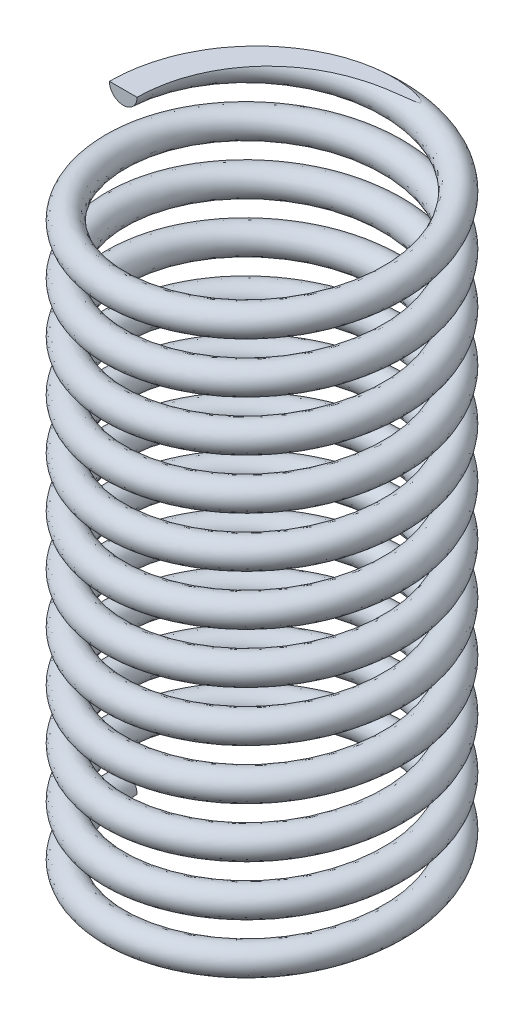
ISO-10303-21;
HEADER;
FILE_DESCRIPTION(('STEP AP214'),'2;1');
FILE_NAME('part.step','',(''),(''),'','','');
FILE_SCHEMA(('AUTOMOTIVE_DESIGN { 1 0 10303 214 1 1 1 1 }'));
ENDSEC;
DATA;
#1=APPLICATION_CONTEXT('core data for automotive mechanical design processes');
#2=APPLICATION_PROTOCOL_DEFINITION('international standard','automotive_design',2000,#1);
#3=PRODUCT_CONTEXT('',#1,'mechanical');
#4=PRODUCT('Part','Part','',(#3));
#5=PRODUCT_RELATED_PRODUCT_CATEGORY('part','',(#4));
#6=PRODUCT_DEFINITION_FORMATION('','',#4);
#7=PRODUCT_DEFINITION_CONTEXT('part definition',#1,'design');
#8=PRODUCT_DEFINITION('design','',#6,#7);
#9=PRODUCT_DEFINITION_SHAPE('','',#8);
#10=(LENGTH_UNIT() NAMED_UNIT(*) SI_UNIT(.MILLI.,.METRE.));
#11=(NAMED_UNIT(*) PLANE_ANGLE_UNIT() SI_UNIT($,.RADIAN.));
#12=(NAMED_UNIT(*) SI_UNIT($,.STERADIAN.) SOLID_ANGLE_UNIT());
#13=UNCERTAINTY_MEASURE_WITH_UNIT(LENGTH_MEASURE(1.E-05),#10,'distance_accuracy_value','');
#14=(GEOMETRIC_REPRESENTATION_CONTEXT(3) GLOBAL_UNCERTAINTY_ASSIGNED_CONTEXT((#13)) GLOBAL_UNIT_ASSIGNED_CONTEXT((#10,
#11,#12)) REPRESENTATION_CONTEXT('',''));
#15=CARTESIAN_POINT('',(0.,0.,0.));
#16=DIRECTION('',(0.,0.,1.));
#17=DIRECTION('',(1.,0.,0.));
#18=AXIS2_PLACEMENT_3D('',#15,#16,#17);
#19=CARTESIAN_POINT('',(-2.5,10.8766534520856,4.18977760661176E-13));
#20=DIRECTION('',(1.6759110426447E-13,0.,1.));
#21=DIRECTION('',(1.,0.,-1.6759110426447E-13));
#22=AXIS2_PLACEMENT_3D('',#19,#20,#21);
#23=PLANE('',#22);
#24=CARTESIAN_POINT('',(-2.5,10.8766534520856,4.18977760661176E-13));
#25=DIRECTION('',(1.6759110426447E-13,0.,1.));
#26=DIRECTION('',(1.,0.,-1.6759110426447E-13));
#27=AXIS2_PLACEMENT_3D('',#24,#25,#26);
#28=CIRCLE('',#27,0.25);
#29=CARTESIAN_POINT('',(-2.75,10.8766534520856,6.42985664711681E-13));
#30=VERTEX_POINT('',#29);
#31=CARTESIAN_POINT('',(-2.25,10.8766534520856,3.77079984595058E-13));
#32=VERTEX_POINT('',#31);
#33=EDGE_CURVE('E69',#30,#32,#28,.T.);
#34=ORIENTED_EDGE('',*,*,#33,.T.);
#35=DIRECTION('',(-1.,0.,1.6759110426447E-13));
#36=VECTOR('',#35,1.);
#37=CARTESIAN_POINT('',(-2.5,10.8766534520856,4.18977760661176E-13));
#38=LINE('',#37,#36);
#39=EDGE_CURVE('E60',#32,#30,#38,.T.);
#40=ORIENTED_EDGE('',*,*,#39,.T.);
#41=EDGE_LOOP('',(#34,#40));
#42=FACE_BOUND('',#41,.T.);
#43=ADVANCED_FACE('F35',(#42),#23,.T.);
#44=CARTESIAN_POINT('',(-2.25,0.,0.));
#45=CARTESIAN_POINT('',(-2.25,0.0755323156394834,1.29903810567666));
#46=CARTESIAN_POINT('',(-1.125,0.151064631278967,1.94855715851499));
#47=CARTESIAN_POINT('',(0.,0.22659694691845,2.59807621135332));
#48=CARTESIAN_POINT('',(1.125,0.302129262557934,1.94855715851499));
#49=CARTESIAN_POINT('',(2.25,0.377661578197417,1.29903810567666));
#50=CARTESIAN_POINT('',(2.25,0.4531938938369,0.));
#51=CARTESIAN_POINT('',(2.25,0.528726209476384,-1.29903810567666));
#52=CARTESIAN_POINT('',(1.125,0.604258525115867,-1.94855715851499));
#53=CARTESIAN_POINT('',(0.,0.679790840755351,-2.59807621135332));
#54=CARTESIAN_POINT('',(-1.125,0.755323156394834,-1.94855715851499));
#55=CARTESIAN_POINT('',(-2.25,0.830855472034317,-1.29903810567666));
#56=CARTESIAN_POINT('',(-2.25,0.906387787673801,0.));
#57=CARTESIAN_POINT('',(-2.25,0.981920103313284,1.29903810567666));
#58=CARTESIAN_POINT('',(-1.125,1.05745241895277,1.94855715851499));
#59=CARTESIAN_POINT('',(0.,1.13298473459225,2.59807621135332));
#60=CARTESIAN_POINT('',(1.125,1.20851705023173,1.94855715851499));
#61=CARTESIAN_POINT('',(2.25,1.28404936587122,1.29903810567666));
#62=CARTESIAN_POINT('',(2.25,1.3595816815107,0.));
#63=CARTESIAN_POINT('',(2.25,1.43511399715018,-1.29903810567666));
#64=CARTESIAN_POINT('',(1.125,1.51064631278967,-1.94855715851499));
#65=CARTESIAN_POINT('',(0.,1.58617862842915,-2.59807621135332));
#66=CARTESIAN_POINT('',(-1.125,1.66171094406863,-1.94855715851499));
#67=CARTESIAN_POINT('',(-2.25,1.73724325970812,-1.29903810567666));
#68=CARTESIAN_POINT('',(-2.25,1.8127755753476,0.));
#69=CARTESIAN_POINT('',(-2.25,1.88830789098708,1.29903810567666));
#70=CARTESIAN_POINT('',(-1.125,1.96384020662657,1.94855715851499));
#71=CARTESIAN_POINT('',(0.,2.03937252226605,2.59807621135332));
#72=CARTESIAN_POINT('',(1.125,2.11490483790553,1.94855715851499));
#73=CARTESIAN_POINT('',(2.25,2.19043715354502,1.29903810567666));
#74=CARTESIAN_POINT('',(2.25,2.2659694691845,0.));
#75=CARTESIAN_POINT('',(2.25,2.34150178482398,-1.29903810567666));
#76=CARTESIAN_POINT('',(1.125,2.41703410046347,-1.94855715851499));
#77=CARTESIAN_POINT('',(0.,2.49256641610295,-2.59807621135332));
#78=CARTESIAN_POINT('',(-1.125,2.56809873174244,-1.94855715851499));
#79=CARTESIAN_POINT('',(-2.25,2.64363104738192,-1.29903810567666));
#80=CARTESIAN_POINT('',(-2.25,2.7191633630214,0.));
#81=CARTESIAN_POINT('',(-2.25,2.79469567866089,1.29903810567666));
#82=CARTESIAN_POINT('',(-1.125,2.87022799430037,1.94855715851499));
#83=CARTESIAN_POINT('',(0.,2.94576030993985,2.59807621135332));
#84=CARTESIAN_POINT('',(1.125,3.02129262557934,1.94855715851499));
#85=CARTESIAN_POINT('',(2.25,3.09682494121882,1.29903810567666));
#86=CARTESIAN_POINT('',(2.25,3.1723572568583,0.));
#87=CARTESIAN_POINT('',(2.25,3.24788957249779,-1.29903810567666));
#88=CARTESIAN_POINT('',(1.125,3.32342188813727,-1.94855715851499));
#89=CARTESIAN_POINT('',(0.,3.39895420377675,-2.59807621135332));
#90=CARTESIAN_POINT('',(-1.125,3.47448651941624,-1.94855715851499));
#91=CARTESIAN_POINT('',(-2.25,3.55001883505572,-1.29903810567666));
#92=CARTESIAN_POINT('',(-2.25,3.6255511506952,0.));
#93=CARTESIAN_POINT('',(-2.25,3.70108346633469,1.29903810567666));
#94=CARTESIAN_POINT('',(-1.125,3.77661578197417,1.94855715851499));
#95=CARTESIAN_POINT('',(0.,3.85214809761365,2.59807621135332));
#96=CARTESIAN_POINT('',(1.125,3.92768041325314,1.94855715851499));
#97=CARTESIAN_POINT('',(2.25,4.00321272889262,1.29903810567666));
#98=CARTESIAN_POINT('',(2.25,4.0787450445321,0.));
#99=CARTESIAN_POINT('',(2.25,4.15427736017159,-1.29903810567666));
#100=CARTESIAN_POINT('',(1.125,4.22980967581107,-1.94855715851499));
#101=CARTESIAN_POINT('',(0.,4.30534199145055,-2.59807621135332));
#102=CARTESIAN_POINT('',(-1.125,4.38087430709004,-1.94855715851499));
#103=CARTESIAN_POINT('',(-2.25,4.45640662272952,-1.29903810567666));
#104=CARTESIAN_POINT('',(-2.25,4.531938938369,0.));
#105=CARTESIAN_POINT('',(-2.25,4.60747125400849,1.29903810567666));
#106=CARTESIAN_POINT('',(-1.125,4.68300356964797,1.94855715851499));
#107=CARTESIAN_POINT('',(0.,4.75853588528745,2.59807621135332));
#108=CARTESIAN_POINT('',(1.125,4.83406820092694,1.94855715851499));
#109=CARTESIAN_POINT('',(2.25,4.90960051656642,1.29903810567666));
#110=CARTESIAN_POINT('',(2.25,4.9851328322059,0.));
#111=CARTESIAN_POINT('',(2.25,5.06066514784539,-1.29903810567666));
#112=CARTESIAN_POINT('',(1.125,5.13619746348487,-1.94855715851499));
#113=CARTESIAN_POINT('',(0.,5.21172977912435,-2.59807621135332));
#114=CARTESIAN_POINT('',(-1.125,5.28726209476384,-1.94855715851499));
#115=CARTESIAN_POINT('',(-2.25,5.36279441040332,-1.29903810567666));
#116=CARTESIAN_POINT('',(-2.25,5.4383267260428,0.));
#117=CARTESIAN_POINT('',(-2.25,5.51385904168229,1.29903810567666));
#118=CARTESIAN_POINT('',(-1.125,5.58939135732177,1.94855715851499));
#119=CARTESIAN_POINT('',(0.,5.66492367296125,2.59807621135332));
#120=CARTESIAN_POINT('',(1.125,5.74045598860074,1.94855715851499));
#121=CARTESIAN_POINT('',(2.25,5.81598830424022,1.29903810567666));
#122=CARTESIAN_POINT('',(2.25,5.8915206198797,0.));
#123=CARTESIAN_POINT('',(2.25,5.96705293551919,-1.29903810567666));
#124=CARTESIAN_POINT('',(1.125,6.04258525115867,-1.94855715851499));
#125=CARTESIAN_POINT('',(0.,6.11811756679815,-2.59807621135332));
#126=CARTESIAN_POINT('',(-1.125,6.19364988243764,-1.94855715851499));
#127=CARTESIAN_POINT('',(-2.25,6.26918219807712,-1.29903810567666));
#128=CARTESIAN_POINT('',(-2.25,6.3447145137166,0.));
#129=CARTESIAN_POINT('',(-2.25,6.42024682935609,1.29903810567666));
#130=CARTESIAN_POINT('',(-1.125,6.49577914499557,1.94855715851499));
#131=CARTESIAN_POINT('',(0.,6.57131146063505,2.59807621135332));
#132=CARTESIAN_POINT('',(1.125,6.64684377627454,1.94855715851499));
#133=CARTESIAN_POINT('',(2.25,6.72237609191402,1.29903810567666));
#134=CARTESIAN_POINT('',(2.25,6.79790840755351,0.));
#135=CARTESIAN_POINT('',(2.25,6.87344072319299,-1.29903810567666));
#136=CARTESIAN_POINT('',(1.125,6.94897303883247,-1.94855715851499));
#137=CARTESIAN_POINT('',(0.,7.02450535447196,-2.59807621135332));
#138=CARTESIAN_POINT('',(-1.125,7.10003767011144,-1.94855715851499));
#139=CARTESIAN_POINT('',(-2.25,7.17556998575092,-1.29903810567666));
#140=CARTESIAN_POINT('',(-2.25,7.25110230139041,0.));
#141=CARTESIAN_POINT('',(-2.25,7.32663461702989,1.29903810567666));
#142=CARTESIAN_POINT('',(-1.125,7.40216693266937,1.94855715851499));
#143=CARTESIAN_POINT('',(0.,7.47769924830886,2.59807621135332));
#144=CARTESIAN_POINT('',(1.125,7.55323156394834,1.94855715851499));
#145=CARTESIAN_POINT('',(2.25,7.62876387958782,1.29903810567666));
#146=CARTESIAN_POINT('',(2.25,7.70429619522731,0.));
#147=CARTESIAN_POINT('',(2.25,7.77982851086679,-1.29903810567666));
#148=CARTESIAN_POINT('',(1.125,7.85536082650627,-1.94855715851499));
#149=CARTESIAN_POINT('',(0.,7.93089314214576,-2.59807621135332));
#150=CARTESIAN_POINT('',(-1.125,8.00642545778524,-1.94855715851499));
#151=CARTESIAN_POINT('',(-2.25,8.08195777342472,-1.29903810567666));
#152=CARTESIAN_POINT('',(-2.25,8.15749008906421,0.));
#153=CARTESIAN_POINT('',(-2.25,8.23302240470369,1.29903810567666));
#154=CARTESIAN_POINT('',(-1.125,8.30855472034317,1.94855715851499));
#155=CARTESIAN_POINT('',(0.,8.38408703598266,2.59807621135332));
#156=CARTESIAN_POINT('',(1.125,8.45961935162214,1.94855715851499));
#157=CARTESIAN_POINT('',(2.25,8.53515166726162,1.29903810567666));
#158=CARTESIAN_POINT('',(2.25,8.61068398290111,0.));
#159=CARTESIAN_POINT('',(2.25,8.68621629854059,-1.29903810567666));
#160=CARTESIAN_POINT('',(1.125,8.76174861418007,-1.94855715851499));
#161=CARTESIAN_POINT('',(0.,8.83728092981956,-2.59807621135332));
#162=CARTESIAN_POINT('',(-1.125,8.91281324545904,-1.94855715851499));
#163=CARTESIAN_POINT('',(-2.25,8.98834556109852,-1.29903810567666));
#164=CARTESIAN_POINT('',(-2.25,9.06387787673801,0.));
#165=CARTESIAN_POINT('',(-2.25,9.13941019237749,1.29903810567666));
#166=CARTESIAN_POINT('',(-1.125,9.21494250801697,1.94855715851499));
#167=CARTESIAN_POINT('',(0.,9.29047482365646,2.59807621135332));
#168=CARTESIAN_POINT('',(1.125,9.36600713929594,1.94855715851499));
#169=CARTESIAN_POINT('',(2.25,9.44153945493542,1.29903810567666));
#170=CARTESIAN_POINT('',(2.25,9.51707177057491,0.));
#171=CARTESIAN_POINT('',(2.25,9.59260408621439,-1.29903810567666));
#172=CARTESIAN_POINT('',(1.125,9.66813640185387,-1.94855715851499));
#173=CARTESIAN_POINT('',(0.,9.74366871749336,-2.59807621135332));
#174=CARTESIAN_POINT('',(-1.125,9.81920103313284,-1.94855715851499));
#175=CARTESIAN_POINT('',(-2.25,9.89473334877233,-1.29903810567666));
#176=CARTESIAN_POINT('',(-2.25,9.97026566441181,0.));
#177=CARTESIAN_POINT('',(-2.25,10.0457979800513,1.29903810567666));
#178=CARTESIAN_POINT('',(-1.125,10.1213302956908,1.94855715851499));
#179=CARTESIAN_POINT('',(0.,10.1968626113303,2.59807621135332));
#180=CARTESIAN_POINT('',(1.125,10.2723949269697,1.94855715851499));
#181=CARTESIAN_POINT('',(2.25,10.3479272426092,1.29903810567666));
#182=CARTESIAN_POINT('',(2.25,10.4234595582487,0.));
#183=CARTESIAN_POINT('',(2.25,10.4989918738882,-1.29903810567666));
#184=CARTESIAN_POINT('',(1.125,10.5745241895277,-1.94855715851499));
#185=CARTESIAN_POINT('',(0.,10.6500565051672,-2.59807621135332));
#186=CARTESIAN_POINT('',(-1.125,10.7255888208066,-1.94855715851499));
#187=CARTESIAN_POINT('',(-2.25,10.8011211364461,-1.29903810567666));
#188=CARTESIAN_POINT('',(-2.25,10.8766534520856,0.));
#189=CARTESIAN_POINT('',(-2.25,10.9521857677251,1.29903810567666));
#190=CARTESIAN_POINT('',(-1.125,11.0277180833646,1.94855715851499));
#191=CARTESIAN_POINT('',(0.,11.1032503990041,2.59807621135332));
#192=CARTESIAN_POINT('',(1.125,11.1787827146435,1.94855715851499));
#193=CARTESIAN_POINT('',(2.25,11.254315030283,1.29903810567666));
#194=CARTESIAN_POINT('',(2.25,11.3298473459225,0.));
#195=CARTESIAN_POINT('',(2.25,11.405379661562,-1.29903810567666));
#196=CARTESIAN_POINT('',(1.125,11.4809119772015,-1.94855715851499));
#197=CARTESIAN_POINT('',(0.,11.556444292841,-2.59807621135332));
#198=CARTESIAN_POINT('',(-1.125,11.6319766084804,-1.94855715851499));
#199=CARTESIAN_POINT('',(-2.25,11.7075089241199,-1.29903810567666));
#200=CARTESIAN_POINT('',(-2.25,11.7830412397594,0.));
#201=CARTESIAN_POINT('',(-2.25,0.5,0.));
#202=CARTESIAN_POINT('',(-2.25,0.575532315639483,1.29903810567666));
#203=CARTESIAN_POINT('',(-1.125,0.651064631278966,1.94855715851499));
#204=CARTESIAN_POINT('',(0.,0.72659694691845,2.59807621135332));
#205=CARTESIAN_POINT('',(1.125,0.802129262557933,1.94855715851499));
#206=CARTESIAN_POINT('',(2.25,0.877661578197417,1.29903810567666));
#207=CARTESIAN_POINT('',(2.25,0.9531938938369,0.));
#208=CARTESIAN_POINT('',(2.25,1.02872620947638,-1.29903810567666));
#209=CARTESIAN_POINT('',(1.125,1.10425852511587,-1.94855715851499));
#210=CARTESIAN_POINT('',(0.,1.17979084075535,-2.59807621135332));
#211=CARTESIAN_POINT('',(-1.125,1.25532315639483,-1.94855715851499));
#212=CARTESIAN_POINT('',(-2.25,1.33085547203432,-1.29903810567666));
#213=CARTESIAN_POINT('',(-2.25,1.4063877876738,0.));
#214=CARTESIAN_POINT('',(-2.25,1.48192010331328,1.29903810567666));
#215=CARTESIAN_POINT('',(-1.125,1.55745241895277,1.94855715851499));
#216=CARTESIAN_POINT('',(0.,1.63298473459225,2.59807621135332));
#217=CARTESIAN_POINT('',(1.125,1.70851705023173,1.94855715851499));
#218=CARTESIAN_POINT('',(2.25,1.78404936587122,1.29903810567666));
#219=CARTESIAN_POINT('',(2.25,1.8595816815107,0.));
#220=CARTESIAN_POINT('',(2.25,1.93511399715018,-1.29903810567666));
#221=CARTESIAN_POINT('',(1.125,2.01064631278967,-1.94855715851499));
#222=CARTESIAN_POINT('',(0.,2.08617862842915,-2.59807621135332));
#223=CARTESIAN_POINT('',(-1.125,2.16171094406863,-1.94855715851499));
#224=CARTESIAN_POINT('',(-2.25,2.23724325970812,-1.29903810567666));
#225=CARTESIAN_POINT('',(-2.25,2.3127755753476,0.));
#226=CARTESIAN_POINT('',(-2.25,2.38830789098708,1.29903810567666));
#227=CARTESIAN_POINT('',(-1.125,2.46384020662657,1.94855715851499));
#228=CARTESIAN_POINT('',(0.,2.53937252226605,2.59807621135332));
#229=CARTESIAN_POINT('',(1.125,2.61490483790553,1.94855715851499));
#230=CARTESIAN_POINT('',(2.25,2.69043715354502,1.29903810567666));
#231=CARTESIAN_POINT('',(2.25,2.7659694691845,0.));
#232=CARTESIAN_POINT('',(2.25,2.84150178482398,-1.29903810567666));
#233=CARTESIAN_POINT('',(1.125,2.91703410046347,-1.94855715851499));
#234=CARTESIAN_POINT('',(0.,2.99256641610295,-2.59807621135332));
#235=CARTESIAN_POINT('',(-1.125,3.06809873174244,-1.94855715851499));
#236=CARTESIAN_POINT('',(-2.25,3.14363104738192,-1.29903810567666));
#237=CARTESIAN_POINT('',(-2.25,3.2191633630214,0.));
#238=CARTESIAN_POINT('',(-2.25,3.29469567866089,1.29903810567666));
#239=CARTESIAN_POINT('',(-1.125,3.37022799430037,1.94855715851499));
#240=CARTESIAN_POINT('',(0.,3.44576030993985,2.59807621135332));
#241=CARTESIAN_POINT('',(1.125,3.52129262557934,1.94855715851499));
#242=CARTESIAN_POINT('',(2.25,3.59682494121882,1.29903810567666));
#243=CARTESIAN_POINT('',(2.25,3.6723572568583,0.));
#244=CARTESIAN_POINT('',(2.25,3.74788957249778,-1.29903810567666));
#245=CARTESIAN_POINT('',(1.125,3.82342188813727,-1.94855715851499));
#246=CARTESIAN_POINT('',(0.,3.89895420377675,-2.59807621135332));
#247=CARTESIAN_POINT('',(-1.125,3.97448651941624,-1.94855715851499));
#248=CARTESIAN_POINT('',(-2.25,4.05001883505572,-1.29903810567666));
#249=CARTESIAN_POINT('',(-2.25,4.1255511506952,0.));
#250=CARTESIAN_POINT('',(-2.25,4.20108346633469,1.29903810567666));
#251=CARTESIAN_POINT('',(-1.125,4.27661578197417,1.94855715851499));
#252=CARTESIAN_POINT('',(0.,4.35214809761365,2.59807621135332));
#253=CARTESIAN_POINT('',(1.125,4.42768041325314,1.94855715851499));
#254=CARTESIAN_POINT('',(2.25,4.50321272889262,1.29903810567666));
#255=CARTESIAN_POINT('',(2.25,4.5787450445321,0.));
#256=CARTESIAN_POINT('',(2.25,4.65427736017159,-1.29903810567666));
#257=CARTESIAN_POINT('',(1.125,4.72980967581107,-1.94855715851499));
#258=CARTESIAN_POINT('',(0.,4.80534199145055,-2.59807621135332));
#259=CARTESIAN_POINT('',(-1.125,4.88087430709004,-1.94855715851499));
#260=CARTESIAN_POINT('',(-2.25,4.95640662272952,-1.29903810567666));
#261=CARTESIAN_POINT('',(-2.25,5.031938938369,0.));
#262=CARTESIAN_POINT('',(-2.25,5.10747125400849,1.29903810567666));
#263=CARTESIAN_POINT('',(-1.125,5.18300356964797,1.94855715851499));
#264=CARTESIAN_POINT('',(0.,5.25853588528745,2.59807621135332));
#265=CARTESIAN_POINT('',(1.125,5.33406820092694,1.94855715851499));
#266=CARTESIAN_POINT('',(2.25,5.40960051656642,1.29903810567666));
#267=CARTESIAN_POINT('',(2.25,5.4851328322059,0.));
#268=CARTESIAN_POINT('',(2.25,5.56066514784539,-1.29903810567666));
#269=CARTESIAN_POINT('',(1.125,5.63619746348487,-1.94855715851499));
#270=CARTESIAN_POINT('',(0.,5.71172977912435,-2.59807621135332));
#271=CARTESIAN_POINT('',(-1.125,5.78726209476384,-1.94855715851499));
#272=CARTESIAN_POINT('',(-2.25,5.86279441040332,-1.29903810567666));
#273=CARTESIAN_POINT('',(-2.25,5.9383267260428,0.));
#274=CARTESIAN_POINT('',(-2.25,6.01385904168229,1.29903810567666));
#275=CARTESIAN_POINT('',(-1.125,6.08939135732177,1.94855715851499));
#276=CARTESIAN_POINT('',(0.,6.16492367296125,2.59807621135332));
#277=CARTESIAN_POINT('',(1.125,6.24045598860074,1.94855715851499));
#278=CARTESIAN_POINT('',(2.25,6.31598830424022,1.29903810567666));
#279=CARTESIAN_POINT('',(2.25,6.3915206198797,0.));
#280=CARTESIAN_POINT('',(2.25,6.46705293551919,-1.29903810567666));
#281=CARTESIAN_POINT('',(1.125,6.54258525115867,-1.94855715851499));
#282=CARTESIAN_POINT('',(0.,6.61811756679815,-2.59807621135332));
#283=CARTESIAN_POINT('',(-1.125,6.69364988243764,-1.94855715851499));
#284=CARTESIAN_POINT('',(-2.25,6.76918219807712,-1.29903810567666));
#285=CARTESIAN_POINT('',(-2.25,6.8447145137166,0.));
#286=CARTESIAN_POINT('',(-2.25,6.92024682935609,1.29903810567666));
#287=CARTESIAN_POINT('',(-1.125,6.99577914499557,1.94855715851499));
#288=CARTESIAN_POINT('',(0.,7.07131146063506,2.59807621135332));
#289=CARTESIAN_POINT('',(1.125,7.14684377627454,1.94855715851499));
#290=CARTESIAN_POINT('',(2.25,7.22237609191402,1.29903810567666));
#291=CARTESIAN_POINT('',(2.25,7.29790840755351,0.));
#292=CARTESIAN_POINT('',(2.25,7.37344072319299,-1.29903810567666));
#293=CARTESIAN_POINT('',(1.125,7.44897303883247,-1.94855715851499));
#294=CARTESIAN_POINT('',(0.,7.52450535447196,-2.59807621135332));
#295=CARTESIAN_POINT('',(-1.125,7.60003767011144,-1.94855715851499));
#296=CARTESIAN_POINT('',(-2.25,7.67556998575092,-1.29903810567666));
#297=CARTESIAN_POINT('',(-2.25,7.75110230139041,0.));
#298=CARTESIAN_POINT('',(-2.25,7.82663461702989,1.29903810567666));
#299=CARTESIAN_POINT('',(-1.125,7.90216693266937,1.94855715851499));
#300=CARTESIAN_POINT('',(0.,7.97769924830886,2.59807621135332));
#301=CARTESIAN_POINT('',(1.125,8.05323156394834,1.94855715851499));
#302=CARTESIAN_POINT('',(2.25,8.12876387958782,1.29903810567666));
#303=CARTESIAN_POINT('',(2.25,8.20429619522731,0.));
#304=CARTESIAN_POINT('',(2.25,8.27982851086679,-1.29903810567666));
#305=CARTESIAN_POINT('',(1.125,8.35536082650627,-1.94855715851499));
#306=CARTESIAN_POINT('',(0.,8.43089314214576,-2.59807621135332));
#307=CARTESIAN_POINT('',(-1.125,8.50642545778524,-1.94855715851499));
#308=CARTESIAN_POINT('',(-2.25,8.58195777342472,-1.29903810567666));
#309=CARTESIAN_POINT('',(-2.25,8.65749008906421,0.));
#310=CARTESIAN_POINT('',(-2.25,8.73302240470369,1.29903810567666));
#311=CARTESIAN_POINT('',(-1.125,8.80855472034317,1.94855715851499));
#312=CARTESIAN_POINT('',(0.,8.88408703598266,2.59807621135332));
#313=CARTESIAN_POINT('',(1.125,8.95961935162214,1.94855715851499));
#314=CARTESIAN_POINT('',(2.25,9.03515166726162,1.29903810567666));
#315=CARTESIAN_POINT('',(2.25,9.11068398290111,0.));
#316=CARTESIAN_POINT('',(2.25,9.18621629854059,-1.29903810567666));
#317=CARTESIAN_POINT('',(1.125,9.26174861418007,-1.94855715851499));
#318=CARTESIAN_POINT('',(0.,9.33728092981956,-2.59807621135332));
#319=CARTESIAN_POINT('',(-1.125,9.41281324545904,-1.94855715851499));
#320=CARTESIAN_POINT('',(-2.25,9.48834556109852,-1.29903810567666));
#321=CARTESIAN_POINT('',(-2.25,9.56387787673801,0.));
#322=CARTESIAN_POINT('',(-2.25,9.63941019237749,1.29903810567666));
#323=CARTESIAN_POINT('',(-1.125,9.71494250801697,1.94855715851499));
#324=CARTESIAN_POINT('',(0.,9.79047482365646,2.59807621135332));
#325=CARTESIAN_POINT('',(1.125,9.86600713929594,1.94855715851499));
#326=CARTESIAN_POINT('',(2.25,9.94153945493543,1.29903810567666));
#327=CARTESIAN_POINT('',(2.25,10.0170717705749,0.));
#328=CARTESIAN_POINT('',(2.25,10.0926040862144,-1.29903810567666));
#329=CARTESIAN_POINT('',(1.125,10.1681364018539,-1.94855715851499));
#330=CARTESIAN_POINT('',(0.,10.2436687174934,-2.59807621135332));
#331=CARTESIAN_POINT('',(-1.125,10.3192010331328,-1.94855715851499));
#332=CARTESIAN_POINT('',(-2.25,10.3947333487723,-1.29903810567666));
#333=CARTESIAN_POINT('',(-2.25,10.4702656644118,0.));
#334=CARTESIAN_POINT('',(-2.25,10.5457979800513,1.29903810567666));
#335=CARTESIAN_POINT('',(-1.125,10.6213302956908,1.94855715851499));
#336=CARTESIAN_POINT('',(0.,10.6968626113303,2.59807621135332));
#337=CARTESIAN_POINT('',(1.125,10.7723949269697,1.94855715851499));
#338=CARTESIAN_POINT('',(2.25,10.8479272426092,1.29903810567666));
#339=CARTESIAN_POINT('',(2.25,10.9234595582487,0.));
#340=CARTESIAN_POINT('',(2.25,10.9989918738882,-1.29903810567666));
#341=CARTESIAN_POINT('',(1.125,11.0745241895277,-1.94855715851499));
#342=CARTESIAN_POINT('',(0.,11.1500565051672,-2.59807621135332));
#343=CARTESIAN_POINT('',(-1.125,11.2255888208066,-1.94855715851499));
#344=CARTESIAN_POINT('',(-2.25,11.3011211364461,-1.29903810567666));
#345=CARTESIAN_POINT('',(-2.25,11.3766534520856,0.));
#346=CARTESIAN_POINT('',(-2.25,11.4521857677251,1.29903810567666));
#347=CARTESIAN_POINT('',(-1.125,11.5277180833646,1.94855715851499));
#348=CARTESIAN_POINT('',(0.,11.6032503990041,2.59807621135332));
#349=CARTESIAN_POINT('',(1.125,11.6787827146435,1.94855715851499));
#350=CARTESIAN_POINT('',(2.25,11.754315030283,1.29903810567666));
#351=CARTESIAN_POINT('',(2.25,11.8298473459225,0.));
#352=CARTESIAN_POINT('',(2.25,11.905379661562,-1.29903810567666));
#353=CARTESIAN_POINT('',(1.125,11.9809119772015,-1.94855715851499));
#354=CARTESIAN_POINT('',(0.,12.056444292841,-2.59807621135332));
#355=CARTESIAN_POINT('',(-1.125,12.1319766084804,-1.94855715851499));
#356=CARTESIAN_POINT('',(-2.25,12.2075089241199,-1.29903810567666));
#357=CARTESIAN_POINT('',(-2.25,12.2830412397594,0.));
#358=CARTESIAN_POINT('',(-2.75,0.5,0.));
#359=CARTESIAN_POINT('',(-2.75,0.575532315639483,1.58771324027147));
#360=CARTESIAN_POINT('',(-1.375,0.651064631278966,2.38156986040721));
#361=CARTESIAN_POINT('',(0.,0.72659694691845,3.17542648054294));
#362=CARTESIAN_POINT('',(1.375,0.802129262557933,2.38156986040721));
#363=CARTESIAN_POINT('',(2.75,0.877661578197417,1.58771324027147));
#364=CARTESIAN_POINT('',(2.75,0.9531938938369,0.));
#365=CARTESIAN_POINT('',(2.75,1.02872620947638,-1.58771324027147));
#366=CARTESIAN_POINT('',(1.375,1.10425852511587,-2.38156986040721));
#367=CARTESIAN_POINT('',(0.,1.17979084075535,-3.17542648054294));
#368=CARTESIAN_POINT('',(-1.375,1.25532315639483,-2.38156986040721));
#369=CARTESIAN_POINT('',(-2.75,1.33085547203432,-1.58771324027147));
#370=CARTESIAN_POINT('',(-2.75,1.4063877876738,0.));
#371=CARTESIAN_POINT('',(-2.75,1.48192010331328,1.58771324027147));
#372=CARTESIAN_POINT('',(-1.375,1.55745241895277,2.38156986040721));
#373=CARTESIAN_POINT('',(0.,1.63298473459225,3.17542648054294));
#374=CARTESIAN_POINT('',(1.375,1.70851705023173,2.38156986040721));
#375=CARTESIAN_POINT('',(2.75,1.78404936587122,1.58771324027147));
#376=CARTESIAN_POINT('',(2.75,1.8595816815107,0.));
#377=CARTESIAN_POINT('',(2.75,1.93511399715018,-1.58771324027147));
#378=CARTESIAN_POINT('',(1.375,2.01064631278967,-2.38156986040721));
#379=CARTESIAN_POINT('',(0.,2.08617862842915,-3.17542648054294));
#380=CARTESIAN_POINT('',(-1.375,2.16171094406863,-2.38156986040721));
#381=CARTESIAN_POINT('',(-2.75,2.23724325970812,-1.58771324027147));
#382=CARTESIAN_POINT('',(-2.75,2.3127755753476,0.));
#383=CARTESIAN_POINT('',(-2.75,2.38830789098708,1.58771324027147));
#384=CARTESIAN_POINT('',(-1.375,2.46384020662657,2.38156986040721));
#385=CARTESIAN_POINT('',(0.,2.53937252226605,3.17542648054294));
#386=CARTESIAN_POINT('',(1.375,2.61490483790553,2.38156986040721));
#387=CARTESIAN_POINT('',(2.75,2.69043715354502,1.58771324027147));
#388=CARTESIAN_POINT('',(2.75,2.7659694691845,0.));
#389=CARTESIAN_POINT('',(2.75,2.84150178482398,-1.58771324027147));
#390=CARTESIAN_POINT('',(1.375,2.91703410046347,-2.38156986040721));
#391=CARTESIAN_POINT('',(0.,2.99256641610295,-3.17542648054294));
#392=CARTESIAN_POINT('',(-1.375,3.06809873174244,-2.38156986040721));
#393=CARTESIAN_POINT('',(-2.75,3.14363104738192,-1.58771324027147));
#394=CARTESIAN_POINT('',(-2.75,3.2191633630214,0.));
#395=CARTESIAN_POINT('',(-2.75,3.29469567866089,1.58771324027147));
#396=CARTESIAN_POINT('',(-1.375,3.37022799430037,2.38156986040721));
#397=CARTESIAN_POINT('',(0.,3.44576030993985,3.17542648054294));
#398=CARTESIAN_POINT('',(1.375,3.52129262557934,2.38156986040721));
#399=CARTESIAN_POINT('',(2.75,3.59682494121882,1.58771324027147));
#400=CARTESIAN_POINT('',(2.75,3.6723572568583,0.));
#401=CARTESIAN_POINT('',(2.75,3.74788957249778,-1.58771324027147));
#402=CARTESIAN_POINT('',(1.375,3.82342188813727,-2.38156986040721));
#403=CARTESIAN_POINT('',(0.,3.89895420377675,-3.17542648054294));
#404=CARTESIAN_POINT('',(-1.375,3.97448651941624,-2.38156986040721));
#405=CARTESIAN_POINT('',(-2.75,4.05001883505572,-1.58771324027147));
#406=CARTESIAN_POINT('',(-2.75,4.1255511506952,0.));
#407=CARTESIAN_POINT('',(-2.75,4.20108346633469,1.58771324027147));
#408=CARTESIAN_POINT('',(-1.375,4.27661578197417,2.38156986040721));
#409=CARTESIAN_POINT('',(0.,4.35214809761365,3.17542648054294));
#410=CARTESIAN_POINT('',(1.375,4.42768041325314,2.38156986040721));
#411=CARTESIAN_POINT('',(2.75,4.50321272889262,1.58771324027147));
#412=CARTESIAN_POINT('',(2.75,4.5787450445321,0.));
#413=CARTESIAN_POINT('',(2.75,4.65427736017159,-1.58771324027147));
#414=CARTESIAN_POINT('',(1.375,4.72980967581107,-2.38156986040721));
#415=CARTESIAN_POINT('',(0.,4.80534199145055,-3.17542648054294));
#416=CARTESIAN_POINT('',(-1.375,4.88087430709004,-2.38156986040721));
#417=CARTESIAN_POINT('',(-2.75,4.95640662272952,-1.58771324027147));
#418=CARTESIAN_POINT('',(-2.75,5.031938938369,0.));
#419=CARTESIAN_POINT('',(-2.75,5.10747125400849,1.58771324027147));
#420=CARTESIAN_POINT('',(-1.375,5.18300356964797,2.38156986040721));
#421=CARTESIAN_POINT('',(0.,5.25853588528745,3.17542648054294));
#422=CARTESIAN_POINT('',(1.375,5.33406820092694,2.38156986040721));
#423=CARTESIAN_POINT('',(2.75,5.40960051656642,1.58771324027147));
#424=CARTESIAN_POINT('',(2.75,5.4851328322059,0.));
#425=CARTESIAN_POINT('',(2.75,5.56066514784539,-1.58771324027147));
#426=CARTESIAN_POINT('',(1.375,5.63619746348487,-2.38156986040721));
#427=CARTESIAN_POINT('',(0.,5.71172977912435,-3.17542648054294));
#428=CARTESIAN_POINT('',(-1.375,5.78726209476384,-2.38156986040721));
#429=CARTESIAN_POINT('',(-2.75,5.86279441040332,-1.58771324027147));
#430=CARTESIAN_POINT('',(-2.75,5.9383267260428,0.));
#431=CARTESIAN_POINT('',(-2.75,6.01385904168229,1.58771324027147));
#432=CARTESIAN_POINT('',(-1.375,6.08939135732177,2.38156986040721));
#433=CARTESIAN_POINT('',(0.,6.16492367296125,3.17542648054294));
#434=CARTESIAN_POINT('',(1.375,6.24045598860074,2.38156986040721));
#435=CARTESIAN_POINT('',(2.75,6.31598830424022,1.58771324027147));
#436=CARTESIAN_POINT('',(2.75,6.3915206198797,0.));
#437=CARTESIAN_POINT('',(2.75,6.46705293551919,-1.58771324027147));
#438=CARTESIAN_POINT('',(1.375,6.54258525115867,-2.38156986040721));
#439=CARTESIAN_POINT('',(0.,6.61811756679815,-3.17542648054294));
#440=CARTESIAN_POINT('',(-1.375,6.69364988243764,-2.38156986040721));
#441=CARTESIAN_POINT('',(-2.75,6.76918219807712,-1.58771324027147));
#442=CARTESIAN_POINT('',(-2.75,6.8447145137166,0.));
#443=CARTESIAN_POINT('',(-2.75,6.92024682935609,1.58771324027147));
#444=CARTESIAN_POINT('',(-1.375,6.99577914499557,2.38156986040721));
#445=CARTESIAN_POINT('',(0.,7.07131146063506,3.17542648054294));
#446=CARTESIAN_POINT('',(1.375,7.14684377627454,2.38156986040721));
#447=CARTESIAN_POINT('',(2.75,7.22237609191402,1.58771324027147));
#448=CARTESIAN_POINT('',(2.75,7.29790840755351,0.));
#449=CARTESIAN_POINT('',(2.75,7.37344072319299,-1.58771324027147));
#450=CARTESIAN_POINT('',(1.375,7.44897303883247,-2.38156986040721));
#451=CARTESIAN_POINT('',(0.,7.52450535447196,-3.17542648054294));
#452=CARTESIAN_POINT('',(-1.375,7.60003767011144,-2.38156986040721));
#453=CARTESIAN_POINT('',(-2.75,7.67556998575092,-1.58771324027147));
#454=CARTESIAN_POINT('',(-2.75,7.75110230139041,0.));
#455=CARTESIAN_POINT('',(-2.75,7.82663461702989,1.58771324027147));
#456=CARTESIAN_POINT('',(-1.375,7.90216693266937,2.38156986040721));
#457=CARTESIAN_POINT('',(0.,7.97769924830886,3.17542648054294));
#458=CARTESIAN_POINT('',(1.375,8.05323156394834,2.38156986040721));
#459=CARTESIAN_POINT('',(2.75,8.12876387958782,1.58771324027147));
#460=CARTESIAN_POINT('',(2.75,8.20429619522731,0.));
#461=CARTESIAN_POINT('',(2.75,8.27982851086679,-1.58771324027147));
#462=CARTESIAN_POINT('',(1.375,8.35536082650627,-2.38156986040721));
#463=CARTESIAN_POINT('',(0.,8.43089314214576,-3.17542648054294));
#464=CARTESIAN_POINT('',(-1.375,8.50642545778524,-2.38156986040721));
#465=CARTESIAN_POINT('',(-2.75,8.58195777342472,-1.58771324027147));
#466=CARTESIAN_POINT('',(-2.75,8.65749008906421,0.));
#467=CARTESIAN_POINT('',(-2.75,8.73302240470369,1.58771324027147));
#468=CARTESIAN_POINT('',(-1.375,8.80855472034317,2.38156986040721));
#469=CARTESIAN_POINT('',(0.,8.88408703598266,3.17542648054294));
#470=CARTESIAN_POINT('',(1.375,8.95961935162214,2.38156986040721));
#471=CARTESIAN_POINT('',(2.75,9.03515166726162,1.58771324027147));
#472=CARTESIAN_POINT('',(2.75,9.11068398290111,0.));
#473=CARTESIAN_POINT('',(2.75,9.18621629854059,-1.58771324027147));
#474=CARTESIAN_POINT('',(1.375,9.26174861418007,-2.38156986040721));
#475=CARTESIAN_POINT('',(0.,9.33728092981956,-3.17542648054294));
#476=CARTESIAN_POINT('',(-1.375,9.41281324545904,-2.38156986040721));
#477=CARTESIAN_POINT('',(-2.75,9.48834556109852,-1.58771324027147));
#478=CARTESIAN_POINT('',(-2.75,9.56387787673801,0.));
#479=CARTESIAN_POINT('',(-2.75,9.63941019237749,1.58771324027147));
#480=CARTESIAN_POINT('',(-1.375,9.71494250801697,2.38156986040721));
#481=CARTESIAN_POINT('',(0.,9.79047482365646,3.17542648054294));
#482=CARTESIAN_POINT('',(1.375,9.86600713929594,2.38156986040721));
#483=CARTESIAN_POINT('',(2.75,9.94153945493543,1.58771324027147));
#484=CARTESIAN_POINT('',(2.75,10.0170717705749,0.));
#485=CARTESIAN_POINT('',(2.75,10.0926040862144,-1.58771324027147));
#486=CARTESIAN_POINT('',(1.375,10.1681364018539,-2.38156986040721));
#487=CARTESIAN_POINT('',(0.,10.2436687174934,-3.17542648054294));
#488=CARTESIAN_POINT('',(-1.375,10.3192010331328,-2.38156986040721));
#489=CARTESIAN_POINT('',(-2.75,10.3947333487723,-1.58771324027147));
#490=CARTESIAN_POINT('',(-2.75,10.4702656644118,0.));
#491=CARTESIAN_POINT('',(-2.75,10.5457979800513,1.58771324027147));
#492=CARTESIAN_POINT('',(-1.375,10.6213302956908,2.38156986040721));
#493=CARTESIAN_POINT('',(0.,10.6968626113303,3.17542648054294));
#494=CARTESIAN_POINT('',(1.375,10.7723949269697,2.38156986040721));
#495=CARTESIAN_POINT('',(2.75,10.8479272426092,1.58771324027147));
#496=CARTESIAN_POINT('',(2.75,10.9234595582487,0.));
#497=CARTESIAN_POINT('',(2.75,10.9989918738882,-1.58771324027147));
#498=CARTESIAN_POINT('',(1.375,11.0745241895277,-2.38156986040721));
#499=CARTESIAN_POINT('',(0.,11.1500565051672,-3.17542648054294));
#500=CARTESIAN_POINT('',(-1.375,11.2255888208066,-2.38156986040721));
#501=CARTESIAN_POINT('',(-2.75,11.3011211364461,-1.58771324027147));
#502=CARTESIAN_POINT('',(-2.75,11.3766534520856,0.));
#503=CARTESIAN_POINT('',(-2.75,11.4521857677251,1.58771324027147));
#504=CARTESIAN_POINT('',(-1.375,11.5277180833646,2.38156986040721));
#505=CARTESIAN_POINT('',(0.,11.6032503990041,3.17542648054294));
#506=CARTESIAN_POINT('',(1.375,11.6787827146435,2.38156986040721));
#507=CARTESIAN_POINT('',(2.75,11.754315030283,1.58771324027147));
#508=CARTESIAN_POINT('',(2.75,11.8298473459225,0.));
#509=CARTESIAN_POINT('',(2.75,11.905379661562,-1.58771324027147));
#510=CARTESIAN_POINT('',(1.375,11.9809119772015,-2.38156986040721));
#511=CARTESIAN_POINT('',(0.,12.056444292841,-3.17542648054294));
#512=CARTESIAN_POINT('',(-1.375,12.1319766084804,-2.38156986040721));
#513=CARTESIAN_POINT('',(-2.75,12.2075089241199,-1.58771324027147));
#514=CARTESIAN_POINT('',(-2.75,12.2830412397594,0.));
#515=CARTESIAN_POINT('',(-2.75,0.,0.));
#516=CARTESIAN_POINT('',(-2.75,0.0755323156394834,1.58771324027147));
#517=CARTESIAN_POINT('',(-1.375,0.151064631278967,2.38156986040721));
#518=CARTESIAN_POINT('',(0.,0.22659694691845,3.17542648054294));
#519=CARTESIAN_POINT('',(1.375,0.302129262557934,2.38156986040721));
#520=CARTESIAN_POINT('',(2.75,0.377661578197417,1.58771324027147));
#521=CARTESIAN_POINT('',(2.75,0.4531938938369,0.));
#522=CARTESIAN_POINT('',(2.75,0.528726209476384,-1.58771324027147));
#523=CARTESIAN_POINT('',(1.375,0.604258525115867,-2.38156986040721));
#524=CARTESIAN_POINT('',(0.,0.679790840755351,-3.17542648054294));
#525=CARTESIAN_POINT('',(-1.375,0.755323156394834,-2.38156986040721));
#526=CARTESIAN_POINT('',(-2.75,0.830855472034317,-1.58771324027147));
#527=CARTESIAN_POINT('',(-2.75,0.906387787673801,0.));
#528=CARTESIAN_POINT('',(-2.75,0.981920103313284,1.58771324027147));
#529=CARTESIAN_POINT('',(-1.375,1.05745241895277,2.38156986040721));
#530=CARTESIAN_POINT('',(0.,1.13298473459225,3.17542648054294));
#531=CARTESIAN_POINT('',(1.375,1.20851705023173,2.38156986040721));
#532=CARTESIAN_POINT('',(2.75,1.28404936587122,1.58771324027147));
#533=CARTESIAN_POINT('',(2.75,1.3595816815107,0.));
#534=CARTESIAN_POINT('',(2.75,1.43511399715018,-1.58771324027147));
#535=CARTESIAN_POINT('',(1.375,1.51064631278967,-2.38156986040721));
#536=CARTESIAN_POINT('',(0.,1.58617862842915,-3.17542648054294));
#537=CARTESIAN_POINT('',(-1.375,1.66171094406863,-2.38156986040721));
#538=CARTESIAN_POINT('',(-2.75,1.73724325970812,-1.58771324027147));
#539=CARTESIAN_POINT('',(-2.75,1.8127755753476,0.));
#540=CARTESIAN_POINT('',(-2.75,1.88830789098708,1.58771324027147));
#541=CARTESIAN_POINT('',(-1.375,1.96384020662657,2.38156986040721));
#542=CARTESIAN_POINT('',(0.,2.03937252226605,3.17542648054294));
#543=CARTESIAN_POINT('',(1.375,2.11490483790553,2.38156986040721));
#544=CARTESIAN_POINT('',(2.75,2.19043715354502,1.58771324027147));
#545=CARTESIAN_POINT('',(2.75,2.2659694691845,0.));
#546=CARTESIAN_POINT('',(2.75,2.34150178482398,-1.58771324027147));
#547=CARTESIAN_POINT('',(1.375,2.41703410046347,-2.38156986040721));
#548=CARTESIAN_POINT('',(0.,2.49256641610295,-3.17542648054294));
#549=CARTESIAN_POINT('',(-1.375,2.56809873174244,-2.38156986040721));
#550=CARTESIAN_POINT('',(-2.75,2.64363104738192,-1.58771324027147));
#551=CARTESIAN_POINT('',(-2.75,2.7191633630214,0.));
#552=CARTESIAN_POINT('',(-2.75,2.79469567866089,1.58771324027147));
#553=CARTESIAN_POINT('',(-1.375,2.87022799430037,2.38156986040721));
#554=CARTESIAN_POINT('',(0.,2.94576030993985,3.17542648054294));
#555=CARTESIAN_POINT('',(1.375,3.02129262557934,2.38156986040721));
#556=CARTESIAN_POINT('',(2.75,3.09682494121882,1.58771324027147));
#557=CARTESIAN_POINT('',(2.75,3.1723572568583,0.));
#558=CARTESIAN_POINT('',(2.75,3.24788957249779,-1.58771324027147));
#559=CARTESIAN_POINT('',(1.375,3.32342188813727,-2.38156986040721));
#560=CARTESIAN_POINT('',(0.,3.39895420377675,-3.17542648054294));
#561=CARTESIAN_POINT('',(-1.375,3.47448651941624,-2.38156986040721));
#562=CARTESIAN_POINT('',(-2.75,3.55001883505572,-1.58771324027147));
#563=CARTESIAN_POINT('',(-2.75,3.6255511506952,0.));
#564=CARTESIAN_POINT('',(-2.75,3.70108346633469,1.58771324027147));
#565=CARTESIAN_POINT('',(-1.375,3.77661578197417,2.38156986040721));
#566=CARTESIAN_POINT('',(0.,3.85214809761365,3.17542648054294));
#567=CARTESIAN_POINT('',(1.375,3.92768041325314,2.38156986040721));
#568=CARTESIAN_POINT('',(2.75,4.00321272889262,1.58771324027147));
#569=CARTESIAN_POINT('',(2.75,4.0787450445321,0.));
#570=CARTESIAN_POINT('',(2.75,4.15427736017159,-1.58771324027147));
#571=CARTESIAN_POINT('',(1.375,4.22980967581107,-2.38156986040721));
#572=CARTESIAN_POINT('',(0.,4.30534199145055,-3.17542648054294));
#573=CARTESIAN_POINT('',(-1.375,4.38087430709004,-2.38156986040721));
#574=CARTESIAN_POINT('',(-2.75,4.45640662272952,-1.58771324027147));
#575=CARTESIAN_POINT('',(-2.75,4.531938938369,0.));
#576=CARTESIAN_POINT('',(-2.75,4.60747125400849,1.58771324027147));
#577=CARTESIAN_POINT('',(-1.375,4.68300356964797,2.38156986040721));
#578=CARTESIAN_POINT('',(0.,4.75853588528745,3.17542648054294));
#579=CARTESIAN_POINT('',(1.375,4.83406820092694,2.38156986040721));
#580=CARTESIAN_POINT('',(2.75,4.90960051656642,1.58771324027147));
#581=CARTESIAN_POINT('',(2.75,4.9851328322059,0.));
#582=CARTESIAN_POINT('',(2.75,5.06066514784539,-1.58771324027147));
#583=CARTESIAN_POINT('',(1.375,5.13619746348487,-2.38156986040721));
#584=CARTESIAN_POINT('',(0.,5.21172977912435,-3.17542648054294));
#585=CARTESIAN_POINT('',(-1.375,5.28726209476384,-2.38156986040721));
#586=CARTESIAN_POINT('',(-2.75,5.36279441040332,-1.58771324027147));
#587=CARTESIAN_POINT('',(-2.75,5.4383267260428,0.));
#588=CARTESIAN_POINT('',(-2.75,5.51385904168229,1.58771324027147));
#589=CARTESIAN_POINT('',(-1.375,5.58939135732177,2.38156986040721));
#590=CARTESIAN_POINT('',(0.,5.66492367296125,3.17542648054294));
#591=CARTESIAN_POINT('',(1.375,5.74045598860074,2.38156986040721));
#592=CARTESIAN_POINT('',(2.75,5.81598830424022,1.58771324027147));
#593=CARTESIAN_POINT('',(2.75,5.8915206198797,0.));
#594=CARTESIAN_POINT('',(2.75,5.96705293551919,-1.58771324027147));
#595=CARTESIAN_POINT('',(1.375,6.04258525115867,-2.38156986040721));
#596=CARTESIAN_POINT('',(0.,6.11811756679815,-3.17542648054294));
#597=CARTESIAN_POINT('',(-1.375,6.19364988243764,-2.38156986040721));
#598=CARTESIAN_POINT('',(-2.75,6.26918219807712,-1.58771324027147));
#599=CARTESIAN_POINT('',(-2.75,6.3447145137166,0.));
#600=CARTESIAN_POINT('',(-2.75,6.42024682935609,1.58771324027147));
#601=CARTESIAN_POINT('',(-1.375,6.49577914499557,2.38156986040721));
#602=CARTESIAN_POINT('',(0.,6.57131146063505,3.17542648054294));
#603=CARTESIAN_POINT('',(1.375,6.64684377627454,2.38156986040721));
#604=CARTESIAN_POINT('',(2.75,6.72237609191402,1.58771324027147));
#605=CARTESIAN_POINT('',(2.75,6.79790840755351,0.));
#606=CARTESIAN_POINT('',(2.75,6.87344072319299,-1.58771324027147));
#607=CARTESIAN_POINT('',(1.375,6.94897303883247,-2.38156986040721));
#608=CARTESIAN_POINT('',(0.,7.02450535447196,-3.17542648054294));
#609=CARTESIAN_POINT('',(-1.375,7.10003767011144,-2.38156986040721));
#610=CARTESIAN_POINT('',(-2.75,7.17556998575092,-1.58771324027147));
#611=CARTESIAN_POINT('',(-2.75,7.25110230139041,0.));
#612=CARTESIAN_POINT('',(-2.75,7.32663461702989,1.58771324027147));
#613=CARTESIAN_POINT('',(-1.375,7.40216693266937,2.38156986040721));
#614=CARTESIAN_POINT('',(0.,7.47769924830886,3.17542648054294));
#615=CARTESIAN_POINT('',(1.375,7.55323156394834,2.38156986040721));
#616=CARTESIAN_POINT('',(2.75,7.62876387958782,1.58771324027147));
#617=CARTESIAN_POINT('',(2.75,7.70429619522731,0.));
#618=CARTESIAN_POINT('',(2.75,7.77982851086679,-1.58771324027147));
#619=CARTESIAN_POINT('',(1.375,7.85536082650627,-2.38156986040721));
#620=CARTESIAN_POINT('',(0.,7.93089314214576,-3.17542648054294));
#621=CARTESIAN_POINT('',(-1.375,8.00642545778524,-2.38156986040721));
#622=CARTESIAN_POINT('',(-2.75,8.08195777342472,-1.58771324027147));
#623=CARTESIAN_POINT('',(-2.75,8.15749008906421,0.));
#624=CARTESIAN_POINT('',(-2.75,8.23302240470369,1.58771324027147));
#625=CARTESIAN_POINT('',(-1.375,8.30855472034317,2.38156986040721));
#626=CARTESIAN_POINT('',(0.,8.38408703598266,3.17542648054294));
#627=CARTESIAN_POINT('',(1.375,8.45961935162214,2.38156986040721));
#628=CARTESIAN_POINT('',(2.75,8.53515166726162,1.58771324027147));
#629=CARTESIAN_POINT('',(2.75,8.61068398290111,0.));
#630=CARTESIAN_POINT('',(2.75,8.68621629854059,-1.58771324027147));
#631=CARTESIAN_POINT('',(1.375,8.76174861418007,-2.38156986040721));
#632=CARTESIAN_POINT('',(0.,8.83728092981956,-3.17542648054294));
#633=CARTESIAN_POINT('',(-1.375,8.91281324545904,-2.38156986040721));
#634=CARTESIAN_POINT('',(-2.75,8.98834556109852,-1.58771324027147));
#635=CARTESIAN_POINT('',(-2.75,9.06387787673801,0.));
#636=CARTESIAN_POINT('',(-2.75,9.13941019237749,1.58771324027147));
#637=CARTESIAN_POINT('',(-1.375,9.21494250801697,2.38156986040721));
#638=CARTESIAN_POINT('',(0.,9.29047482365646,3.17542648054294));
#639=CARTESIAN_POINT('',(1.375,9.36600713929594,2.38156986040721));
#640=CARTESIAN_POINT('',(2.75,9.44153945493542,1.58771324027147));
#641=CARTESIAN_POINT('',(2.75,9.51707177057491,0.));
#642=CARTESIAN_POINT('',(2.75,9.59260408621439,-1.58771324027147));
#643=CARTESIAN_POINT('',(1.375,9.66813640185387,-2.38156986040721));
#644=CARTESIAN_POINT('',(0.,9.74366871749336,-3.17542648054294));
#645=CARTESIAN_POINT('',(-1.375,9.81920103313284,-2.38156986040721));
#646=CARTESIAN_POINT('',(-2.75,9.89473334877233,-1.58771324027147));
#647=CARTESIAN_POINT('',(-2.75,9.97026566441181,0.));
#648=CARTESIAN_POINT('',(-2.75,10.0457979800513,1.58771324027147));
#649=CARTESIAN_POINT('',(-1.375,10.1213302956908,2.38156986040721));
#650=CARTESIAN_POINT('',(0.,10.1968626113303,3.17542648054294));
#651=CARTESIAN_POINT('',(1.375,10.2723949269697,2.38156986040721));
#652=CARTESIAN_POINT('',(2.75,10.3479272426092,1.58771324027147));
#653=CARTESIAN_POINT('',(2.75,10.4234595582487,0.));
#654=CARTESIAN_POINT('',(2.75,10.4989918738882,-1.58771324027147));
#655=CARTESIAN_POINT('',(1.375,10.5745241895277,-2.38156986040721));
#656=CARTESIAN_POINT('',(0.,10.6500565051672,-3.17542648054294));
#657=CARTESIAN_POINT('',(-1.375,10.7255888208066,-2.38156986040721));
#658=CARTESIAN_POINT('',(-2.75,10.8011211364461,-1.58771324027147));
#659=CARTESIAN_POINT('',(-2.75,10.8766534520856,0.));
#660=CARTESIAN_POINT('',(-2.75,10.9521857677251,1.58771324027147));
#661=CARTESIAN_POINT('',(-1.375,11.0277180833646,2.38156986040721));
#662=CARTESIAN_POINT('',(0.,11.1032503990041,3.17542648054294));
#663=CARTESIAN_POINT('',(1.375,11.1787827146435,2.38156986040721));
#664=CARTESIAN_POINT('',(2.75,11.254315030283,1.58771324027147));
#665=CARTESIAN_POINT('',(2.75,11.3298473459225,0.));
#666=CARTESIAN_POINT('',(2.75,11.405379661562,-1.58771324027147));
#667=CARTESIAN_POINT('',(1.375,11.4809119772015,-2.38156986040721));
#668=CARTESIAN_POINT('',(0.,11.556444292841,-3.17542648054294));
#669=CARTESIAN_POINT('',(-1.375,11.6319766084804,-2.38156986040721));
#670=CARTESIAN_POINT('',(-2.75,11.7075089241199,-1.58771324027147));
#671=CARTESIAN_POINT('',(-2.75,11.7830412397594,0.));
#672=CARTESIAN_POINT('',(-2.75,-0.5,0.));
#673=CARTESIAN_POINT('',(-2.75,-0.424467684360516,1.58771324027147));
#674=CARTESIAN_POINT('',(-1.375,-0.348935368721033,2.38156986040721));
#675=CARTESIAN_POINT('',(0.,-0.27340305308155,3.17542648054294));
#676=CARTESIAN_POINT('',(1.375,-0.197870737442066,2.38156986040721));
#677=CARTESIAN_POINT('',(2.75,-0.122338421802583,1.58771324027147));
#678=CARTESIAN_POINT('',(2.75,-0.0468061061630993,0.));
#679=CARTESIAN_POINT('',(2.75,0.028726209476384,-1.58771324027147));
#680=CARTESIAN_POINT('',(1.375,0.104258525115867,-2.38156986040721));
#681=CARTESIAN_POINT('',(0.,0.179790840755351,-3.17542648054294));
#682=CARTESIAN_POINT('',(-1.375,0.255323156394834,-2.38156986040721));
#683=CARTESIAN_POINT('',(-2.75,0.330855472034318,-1.58771324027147));
#684=CARTESIAN_POINT('',(-2.75,0.406387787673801,0.));
#685=CARTESIAN_POINT('',(-2.75,0.481920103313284,1.58771324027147));
#686=CARTESIAN_POINT('',(-1.375,0.557452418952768,2.38156986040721));
#687=CARTESIAN_POINT('',(0.,0.632984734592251,3.17542648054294));
#688=CARTESIAN_POINT('',(1.375,0.708517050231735,2.38156986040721));
#689=CARTESIAN_POINT('',(2.75,0.784049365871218,1.58771324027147));
#690=CARTESIAN_POINT('',(2.75,0.859581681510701,0.));
#691=CARTESIAN_POINT('',(2.75,0.935113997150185,-1.58771324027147));
#692=CARTESIAN_POINT('',(1.375,1.01064631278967,-2.38156986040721));
#693=CARTESIAN_POINT('',(0.,1.08617862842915,-3.17542648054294));
#694=CARTESIAN_POINT('',(-1.375,1.16171094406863,-2.38156986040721));
#695=CARTESIAN_POINT('',(-2.75,1.23724325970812,-1.58771324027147));
#696=CARTESIAN_POINT('',(-2.75,1.3127755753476,0.));
#697=CARTESIAN_POINT('',(-2.75,1.38830789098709,1.58771324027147));
#698=CARTESIAN_POINT('',(-1.375,1.46384020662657,2.38156986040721));
#699=CARTESIAN_POINT('',(0.,1.53937252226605,3.17542648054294));
#700=CARTESIAN_POINT('',(1.375,1.61490483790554,2.38156986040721));
#701=CARTESIAN_POINT('',(2.75,1.69043715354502,1.58771324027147));
#702=CARTESIAN_POINT('',(2.75,1.7659694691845,0.));
#703=CARTESIAN_POINT('',(2.75,1.84150178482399,-1.58771324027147));
#704=CARTESIAN_POINT('',(1.375,1.91703410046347,-2.38156986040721));
#705=CARTESIAN_POINT('',(0.,1.99256641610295,-3.17542648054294));
#706=CARTESIAN_POINT('',(-1.375,2.06809873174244,-2.38156986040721));
#707=CARTESIAN_POINT('',(-2.75,2.14363104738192,-1.58771324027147));
#708=CARTESIAN_POINT('',(-2.75,2.2191633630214,0.));
#709=CARTESIAN_POINT('',(-2.75,2.29469567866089,1.58771324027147));
#710=CARTESIAN_POINT('',(-1.375,2.37022799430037,2.38156986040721));
#711=CARTESIAN_POINT('',(0.,2.44576030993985,3.17542648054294));
#712=CARTESIAN_POINT('',(1.375,2.52129262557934,2.38156986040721));
#713=CARTESIAN_POINT('',(2.75,2.59682494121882,1.58771324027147));
#714=CARTESIAN_POINT('',(2.75,2.6723572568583,0.));
#715=CARTESIAN_POINT('',(2.75,2.74788957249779,-1.58771324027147));
#716=CARTESIAN_POINT('',(1.375,2.82342188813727,-2.38156986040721));
#717=CARTESIAN_POINT('',(0.,2.89895420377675,-3.17542648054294));
#718=CARTESIAN_POINT('',(-1.375,2.97448651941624,-2.38156986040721));
#719=CARTESIAN_POINT('',(-2.75,3.05001883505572,-1.58771324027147));
#720=CARTESIAN_POINT('',(-2.75,3.1255511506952,0.));
#721=CARTESIAN_POINT('',(-2.75,3.20108346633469,1.58771324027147));
#722=CARTESIAN_POINT('',(-1.375,3.27661578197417,2.38156986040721));
#723=CARTESIAN_POINT('',(0.,3.35214809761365,3.17542648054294));
#724=CARTESIAN_POINT('',(1.375,3.42768041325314,2.38156986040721));
#725=CARTESIAN_POINT('',(2.75,3.50321272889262,1.58771324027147));
#726=CARTESIAN_POINT('',(2.75,3.5787450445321,0.));
#727=CARTESIAN_POINT('',(2.75,3.65427736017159,-1.58771324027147));
#728=CARTESIAN_POINT('',(1.375,3.72980967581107,-2.38156986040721));
#729=CARTESIAN_POINT('',(0.,3.80534199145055,-3.17542648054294));
#730=CARTESIAN_POINT('',(-1.375,3.88087430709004,-2.38156986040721));
#731=CARTESIAN_POINT('',(-2.75,3.95640662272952,-1.58771324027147));
#732=CARTESIAN_POINT('',(-2.75,4.031938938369,0.));
#733=CARTESIAN_POINT('',(-2.75,4.10747125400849,1.58771324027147));
#734=CARTESIAN_POINT('',(-1.375,4.18300356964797,2.38156986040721));
#735=CARTESIAN_POINT('',(0.,4.25853588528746,3.17542648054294));
#736=CARTESIAN_POINT('',(1.375,4.33406820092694,2.38156986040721));
#737=CARTESIAN_POINT('',(2.75,4.40960051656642,1.58771324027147));
#738=CARTESIAN_POINT('',(2.75,4.4851328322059,0.));
#739=CARTESIAN_POINT('',(2.75,4.56066514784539,-1.58771324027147));
#740=CARTESIAN_POINT('',(1.375,4.63619746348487,-2.38156986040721));
#741=CARTESIAN_POINT('',(0.,4.71172977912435,-3.17542648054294));
#742=CARTESIAN_POINT('',(-1.375,4.78726209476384,-2.38156986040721));
#743=CARTESIAN_POINT('',(-2.75,4.86279441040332,-1.58771324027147));
#744=CARTESIAN_POINT('',(-2.75,4.9383267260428,0.));
#745=CARTESIAN_POINT('',(-2.75,5.01385904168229,1.58771324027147));
#746=CARTESIAN_POINT('',(-1.375,5.08939135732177,2.38156986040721));
#747=CARTESIAN_POINT('',(0.,5.16492367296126,3.17542648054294));
#748=CARTESIAN_POINT('',(1.375,5.24045598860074,2.38156986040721));
#749=CARTESIAN_POINT('',(2.75,5.31598830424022,1.58771324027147));
#750=CARTESIAN_POINT('',(2.75,5.3915206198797,0.));
#751=CARTESIAN_POINT('',(2.75,5.46705293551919,-1.58771324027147));
#752=CARTESIAN_POINT('',(1.375,5.54258525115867,-2.38156986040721));
#753=CARTESIAN_POINT('',(0.,5.61811756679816,-3.17542648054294));
#754=CARTESIAN_POINT('',(-1.375,5.69364988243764,-2.38156986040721));
#755=CARTESIAN_POINT('',(-2.75,5.76918219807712,-1.58771324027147));
#756=CARTESIAN_POINT('',(-2.75,5.8447145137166,0.));
#757=CARTESIAN_POINT('',(-2.75,5.92024682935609,1.58771324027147));
#758=CARTESIAN_POINT('',(-1.375,5.99577914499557,2.38156986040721));
#759=CARTESIAN_POINT('',(0.,6.07131146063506,3.17542648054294));
#760=CARTESIAN_POINT('',(1.375,6.14684377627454,2.38156986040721));
#761=CARTESIAN_POINT('',(2.75,6.22237609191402,1.58771324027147));
#762=CARTESIAN_POINT('',(2.75,6.29790840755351,0.));
#763=CARTESIAN_POINT('',(2.75,6.37344072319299,-1.58771324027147));
#764=CARTESIAN_POINT('',(1.375,6.44897303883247,-2.38156986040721));
#765=CARTESIAN_POINT('',(0.,6.52450535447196,-3.17542648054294));
#766=CARTESIAN_POINT('',(-1.375,6.60003767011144,-2.38156986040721));
#767=CARTESIAN_POINT('',(-2.75,6.67556998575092,-1.58771324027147));
#768=CARTESIAN_POINT('',(-2.75,6.75110230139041,0.));
#769=CARTESIAN_POINT('',(-2.75,6.82663461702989,1.58771324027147));
#770=CARTESIAN_POINT('',(-1.375,6.90216693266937,2.38156986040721));
#771=CARTESIAN_POINT('',(0.,6.97769924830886,3.17542648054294));
#772=CARTESIAN_POINT('',(1.375,7.05323156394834,2.38156986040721));
#773=CARTESIAN_POINT('',(2.75,7.12876387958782,1.58771324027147));
#774=CARTESIAN_POINT('',(2.75,7.20429619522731,0.));
#775=CARTESIAN_POINT('',(2.75,7.27982851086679,-1.58771324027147));
#776=CARTESIAN_POINT('',(1.375,7.35536082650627,-2.38156986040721));
#777=CARTESIAN_POINT('',(0.,7.43089314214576,-3.17542648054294));
#778=CARTESIAN_POINT('',(-1.375,7.50642545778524,-2.38156986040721));
#779=CARTESIAN_POINT('',(-2.75,7.58195777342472,-1.58771324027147));
#780=CARTESIAN_POINT('',(-2.75,7.65749008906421,0.));
#781=CARTESIAN_POINT('',(-2.75,7.73302240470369,1.58771324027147));
#782=CARTESIAN_POINT('',(-1.375,7.80855472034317,2.38156986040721));
#783=CARTESIAN_POINT('',(0.,7.88408703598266,3.17542648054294));
#784=CARTESIAN_POINT('',(1.375,7.95961935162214,2.38156986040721));
#785=CARTESIAN_POINT('',(2.75,8.03515166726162,1.58771324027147));
#786=CARTESIAN_POINT('',(2.75,8.11068398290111,0.));
#787=CARTESIAN_POINT('',(2.75,8.18621629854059,-1.58771324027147));
#788=CARTESIAN_POINT('',(1.375,8.26174861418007,-2.38156986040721));
#789=CARTESIAN_POINT('',(0.,8.33728092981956,-3.17542648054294));
#790=CARTESIAN_POINT('',(-1.375,8.41281324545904,-2.38156986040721));
#791=CARTESIAN_POINT('',(-2.75,8.48834556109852,-1.58771324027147));
#792=CARTESIAN_POINT('',(-2.75,8.56387787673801,0.));
#793=CARTESIAN_POINT('',(-2.75,8.63941019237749,1.58771324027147));
#794=CARTESIAN_POINT('',(-1.375,8.71494250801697,2.38156986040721));
#795=CARTESIAN_POINT('',(0.,8.79047482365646,3.17542648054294));
#796=CARTESIAN_POINT('',(1.375,8.86600713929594,2.38156986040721));
#797=CARTESIAN_POINT('',(2.75,8.94153945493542,1.58771324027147));
#798=CARTESIAN_POINT('',(2.75,9.01707177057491,0.));
#799=CARTESIAN_POINT('',(2.75,9.09260408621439,-1.58771324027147));
#800=CARTESIAN_POINT('',(1.375,9.16813640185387,-2.38156986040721));
#801=CARTESIAN_POINT('',(0.,9.24366871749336,-3.17542648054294));
#802=CARTESIAN_POINT('',(-1.375,9.31920103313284,-2.38156986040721));
#803=CARTESIAN_POINT('',(-2.75,9.39473334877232,-1.58771324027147));
#804=CARTESIAN_POINT('',(-2.75,9.47026566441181,0.));
#805=CARTESIAN_POINT('',(-2.75,9.54579798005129,1.58771324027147));
#806=CARTESIAN_POINT('',(-1.375,9.62133029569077,2.38156986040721));
#807=CARTESIAN_POINT('',(0.,9.69686261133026,3.17542648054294));
#808=CARTESIAN_POINT('',(1.375,9.77239492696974,2.38156986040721));
#809=CARTESIAN_POINT('',(2.75,9.84792724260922,1.58771324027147));
#810=CARTESIAN_POINT('',(2.75,9.92345955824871,0.));
#811=CARTESIAN_POINT('',(2.75,9.99899187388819,-1.58771324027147));
#812=CARTESIAN_POINT('',(1.375,10.0745241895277,-2.38156986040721));
#813=CARTESIAN_POINT('',(0.,10.1500565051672,-3.17542648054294));
#814=CARTESIAN_POINT('',(-1.375,10.2255888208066,-2.38156986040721));
#815=CARTESIAN_POINT('',(-2.75,10.3011211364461,-1.58771324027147));
#816=CARTESIAN_POINT('',(-2.75,10.3766534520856,0.));
#817=CARTESIAN_POINT('',(-2.75,10.4521857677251,1.58771324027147));
#818=CARTESIAN_POINT('',(-1.375,10.5277180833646,2.38156986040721));
#819=CARTESIAN_POINT('',(0.,10.6032503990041,3.17542648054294));
#820=CARTESIAN_POINT('',(1.375,10.6787827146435,2.38156986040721));
#821=CARTESIAN_POINT('',(2.75,10.754315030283,1.58771324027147));
#822=CARTESIAN_POINT('',(2.75,10.8298473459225,0.));
#823=CARTESIAN_POINT('',(2.75,10.905379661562,-1.58771324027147));
#824=CARTESIAN_POINT('',(1.375,10.9809119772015,-2.38156986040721));
#825=CARTESIAN_POINT('',(0.,11.056444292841,-3.17542648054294));
#826=CARTESIAN_POINT('',(-1.375,11.1319766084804,-2.38156986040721));
#827=CARTESIAN_POINT('',(-2.75,11.2075089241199,-1.58771324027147));
#828=CARTESIAN_POINT('',(-2.75,11.2830412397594,0.));
#829=CARTESIAN_POINT('',(-2.25,-0.5,0.));
#830=CARTESIAN_POINT('',(-2.25,-0.424467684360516,1.29903810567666));
#831=CARTESIAN_POINT('',(-1.125,-0.348935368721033,1.94855715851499));
#832=CARTESIAN_POINT('',(0.,-0.27340305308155,2.59807621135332));
#833=CARTESIAN_POINT('',(1.125,-0.197870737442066,1.94855715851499));
#834=CARTESIAN_POINT('',(2.25,-0.122338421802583,1.29903810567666));
#835=CARTESIAN_POINT('',(2.25,-0.0468061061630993,0.));
#836=CARTESIAN_POINT('',(2.25,0.028726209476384,-1.29903810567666));
#837=CARTESIAN_POINT('',(1.125,0.104258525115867,-1.94855715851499));
#838=CARTESIAN_POINT('',(0.,0.179790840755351,-2.59807621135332));
#839=CARTESIAN_POINT('',(-1.125,0.255323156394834,-1.94855715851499));
#840=CARTESIAN_POINT('',(-2.25,0.330855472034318,-1.29903810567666));
#841=CARTESIAN_POINT('',(-2.25,0.406387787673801,0.));
#842=CARTESIAN_POINT('',(-2.25,0.481920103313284,1.29903810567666));
#843=CARTESIAN_POINT('',(-1.125,0.557452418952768,1.94855715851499));
#844=CARTESIAN_POINT('',(0.,0.632984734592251,2.59807621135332));
#845=CARTESIAN_POINT('',(1.125,0.708517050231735,1.94855715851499));
#846=CARTESIAN_POINT('',(2.25,0.784049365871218,1.29903810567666));
#847=CARTESIAN_POINT('',(2.25,0.859581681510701,0.));
#848=CARTESIAN_POINT('',(2.25,0.935113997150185,-1.29903810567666));
#849=CARTESIAN_POINT('',(1.125,1.01064631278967,-1.94855715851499));
#850=CARTESIAN_POINT('',(0.,1.08617862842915,-2.59807621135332));
#851=CARTESIAN_POINT('',(-1.125,1.16171094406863,-1.94855715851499));
#852=CARTESIAN_POINT('',(-2.25,1.23724325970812,-1.29903810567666));
#853=CARTESIAN_POINT('',(-2.25,1.3127755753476,0.));
#854=CARTESIAN_POINT('',(-2.25,1.38830789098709,1.29903810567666));
#855=CARTESIAN_POINT('',(-1.125,1.46384020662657,1.94855715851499));
#856=CARTESIAN_POINT('',(0.,1.53937252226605,2.59807621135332));
#857=CARTESIAN_POINT('',(1.125,1.61490483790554,1.94855715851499));
#858=CARTESIAN_POINT('',(2.25,1.69043715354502,1.29903810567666));
#859=CARTESIAN_POINT('',(2.25,1.7659694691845,0.));
#860=CARTESIAN_POINT('',(2.25,1.84150178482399,-1.29903810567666));
#861=CARTESIAN_POINT('',(1.125,1.91703410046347,-1.94855715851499));
#862=CARTESIAN_POINT('',(0.,1.99256641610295,-2.59807621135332));
#863=CARTESIAN_POINT('',(-1.125,2.06809873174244,-1.94855715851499));
#864=CARTESIAN_POINT('',(-2.25,2.14363104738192,-1.29903810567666));
#865=CARTESIAN_POINT('',(-2.25,2.2191633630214,0.));
#866=CARTESIAN_POINT('',(-2.25,2.29469567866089,1.29903810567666));
#867=CARTESIAN_POINT('',(-1.125,2.37022799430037,1.94855715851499));
#868=CARTESIAN_POINT('',(0.,2.44576030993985,2.59807621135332));
#869=CARTESIAN_POINT('',(1.125,2.52129262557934,1.94855715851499));
#870=CARTESIAN_POINT('',(2.25,2.59682494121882,1.29903810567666));
#871=CARTESIAN_POINT('',(2.25,2.6723572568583,0.));
#872=CARTESIAN_POINT('',(2.25,2.74788957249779,-1.29903810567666));
#873=CARTESIAN_POINT('',(1.125,2.82342188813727,-1.94855715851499));
#874=CARTESIAN_POINT('',(0.,2.89895420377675,-2.59807621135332));
#875=CARTESIAN_POINT('',(-1.125,2.97448651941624,-1.94855715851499));
#876=CARTESIAN_POINT('',(-2.25,3.05001883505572,-1.29903810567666));
#877=CARTESIAN_POINT('',(-2.25,3.1255511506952,0.));
#878=CARTESIAN_POINT('',(-2.25,3.20108346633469,1.29903810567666));
#879=CARTESIAN_POINT('',(-1.125,3.27661578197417,1.94855715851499));
#880=CARTESIAN_POINT('',(0.,3.35214809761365,2.59807621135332));
#881=CARTESIAN_POINT('',(1.125,3.42768041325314,1.94855715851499));
#882=CARTESIAN_POINT('',(2.25,3.50321272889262,1.29903810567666));
#883=CARTESIAN_POINT('',(2.25,3.5787450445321,0.));
#884=CARTESIAN_POINT('',(2.25,3.65427736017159,-1.29903810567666));
#885=CARTESIAN_POINT('',(1.125,3.72980967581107,-1.94855715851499));
#886=CARTESIAN_POINT('',(0.,3.80534199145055,-2.59807621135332));
#887=CARTESIAN_POINT('',(-1.125,3.88087430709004,-1.94855715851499));
#888=CARTESIAN_POINT('',(-2.25,3.95640662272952,-1.29903810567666));
#889=CARTESIAN_POINT('',(-2.25,4.031938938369,0.));
#890=CARTESIAN_POINT('',(-2.25,4.10747125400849,1.29903810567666));
#891=CARTESIAN_POINT('',(-1.125,4.18300356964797,1.94855715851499));
#892=CARTESIAN_POINT('',(0.,4.25853588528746,2.59807621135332));
#893=CARTESIAN_POINT('',(1.125,4.33406820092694,1.94855715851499));
#894=CARTESIAN_POINT('',(2.25,4.40960051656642,1.29903810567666));
#895=CARTESIAN_POINT('',(2.25,4.4851328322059,0.));
#896=CARTESIAN_POINT('',(2.25,4.56066514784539,-1.29903810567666));
#897=CARTESIAN_POINT('',(1.125,4.63619746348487,-1.94855715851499));
#898=CARTESIAN_POINT('',(0.,4.71172977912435,-2.59807621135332));
#899=CARTESIAN_POINT('',(-1.125,4.78726209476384,-1.94855715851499));
#900=CARTESIAN_POINT('',(-2.25,4.86279441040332,-1.29903810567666));
#901=CARTESIAN_POINT('',(-2.25,4.9383267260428,0.));
#902=CARTESIAN_POINT('',(-2.25,5.01385904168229,1.29903810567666));
#903=CARTESIAN_POINT('',(-1.125,5.08939135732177,1.94855715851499));
#904=CARTESIAN_POINT('',(0.,5.16492367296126,2.59807621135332));
#905=CARTESIAN_POINT('',(1.125,5.24045598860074,1.94855715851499));
#906=CARTESIAN_POINT('',(2.25,5.31598830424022,1.29903810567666));
#907=CARTESIAN_POINT('',(2.25,5.3915206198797,0.));
#908=CARTESIAN_POINT('',(2.25,5.46705293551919,-1.29903810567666));
#909=CARTESIAN_POINT('',(1.125,5.54258525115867,-1.94855715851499));
#910=CARTESIAN_POINT('',(0.,5.61811756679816,-2.59807621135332));
#911=CARTESIAN_POINT('',(-1.125,5.69364988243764,-1.94855715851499));
#912=CARTESIAN_POINT('',(-2.25,5.76918219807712,-1.29903810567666));
#913=CARTESIAN_POINT('',(-2.25,5.8447145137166,0.));
#914=CARTESIAN_POINT('',(-2.25,5.92024682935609,1.29903810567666));
#915=CARTESIAN_POINT('',(-1.125,5.99577914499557,1.94855715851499));
#916=CARTESIAN_POINT('',(0.,6.07131146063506,2.59807621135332));
#917=CARTESIAN_POINT('',(1.125,6.14684377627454,1.94855715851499));
#918=CARTESIAN_POINT('',(2.25,6.22237609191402,1.29903810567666));
#919=CARTESIAN_POINT('',(2.25,6.29790840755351,0.));
#920=CARTESIAN_POINT('',(2.25,6.37344072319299,-1.29903810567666));
#921=CARTESIAN_POINT('',(1.125,6.44897303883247,-1.94855715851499));
#922=CARTESIAN_POINT('',(0.,6.52450535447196,-2.59807621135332));
#923=CARTESIAN_POINT('',(-1.125,6.60003767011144,-1.94855715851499));
#924=CARTESIAN_POINT('',(-2.25,6.67556998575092,-1.29903810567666));
#925=CARTESIAN_POINT('',(-2.25,6.75110230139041,0.));
#926=CARTESIAN_POINT('',(-2.25,6.82663461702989,1.29903810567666));
#927=CARTESIAN_POINT('',(-1.125,6.90216693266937,1.94855715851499));
#928=CARTESIAN_POINT('',(0.,6.97769924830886,2.59807621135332));
#929=CARTESIAN_POINT('',(1.125,7.05323156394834,1.94855715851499));
#930=CARTESIAN_POINT('',(2.25,7.12876387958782,1.29903810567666));
#931=CARTESIAN_POINT('',(2.25,7.20429619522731,0.));
#932=CARTESIAN_POINT('',(2.25,7.27982851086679,-1.29903810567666));
#933=CARTESIAN_POINT('',(1.125,7.35536082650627,-1.94855715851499));
#934=CARTESIAN_POINT('',(0.,7.43089314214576,-2.59807621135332));
#935=CARTESIAN_POINT('',(-1.125,7.50642545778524,-1.94855715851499));
#936=CARTESIAN_POINT('',(-2.25,7.58195777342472,-1.29903810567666));
#937=CARTESIAN_POINT('',(-2.25,7.65749008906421,0.));
#938=CARTESIAN_POINT('',(-2.25,7.73302240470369,1.29903810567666));
#939=CARTESIAN_POINT('',(-1.125,7.80855472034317,1.94855715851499));
#940=CARTESIAN_POINT('',(0.,7.88408703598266,2.59807621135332));
#941=CARTESIAN_POINT('',(1.125,7.95961935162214,1.94855715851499));
#942=CARTESIAN_POINT('',(2.25,8.03515166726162,1.29903810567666));
#943=CARTESIAN_POINT('',(2.25,8.11068398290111,0.));
#944=CARTESIAN_POINT('',(2.25,8.18621629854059,-1.29903810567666));
#945=CARTESIAN_POINT('',(1.125,8.26174861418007,-1.94855715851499));
#946=CARTESIAN_POINT('',(0.,8.33728092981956,-2.59807621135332));
#947=CARTESIAN_POINT('',(-1.125,8.41281324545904,-1.94855715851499));
#948=CARTESIAN_POINT('',(-2.25,8.48834556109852,-1.29903810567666));
#949=CARTESIAN_POINT('',(-2.25,8.56387787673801,0.));
#950=CARTESIAN_POINT('',(-2.25,8.63941019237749,1.29903810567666));
#951=CARTESIAN_POINT('',(-1.125,8.71494250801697,1.94855715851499));
#952=CARTESIAN_POINT('',(0.,8.79047482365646,2.59807621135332));
#953=CARTESIAN_POINT('',(1.125,8.86600713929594,1.94855715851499));
#954=CARTESIAN_POINT('',(2.25,8.94153945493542,1.29903810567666));
#955=CARTESIAN_POINT('',(2.25,9.01707177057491,0.));
#956=CARTESIAN_POINT('',(2.25,9.09260408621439,-1.29903810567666));
#957=CARTESIAN_POINT('',(1.125,9.16813640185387,-1.94855715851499));
#958=CARTESIAN_POINT('',(0.,9.24366871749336,-2.59807621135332));
#959=CARTESIAN_POINT('',(-1.125,9.31920103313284,-1.94855715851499));
#960=CARTESIAN_POINT('',(-2.25,9.39473334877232,-1.29903810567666));
#961=CARTESIAN_POINT('',(-2.25,9.47026566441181,0.));
#962=CARTESIAN_POINT('',(-2.25,9.54579798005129,1.29903810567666));
#963=CARTESIAN_POINT('',(-1.125,9.62133029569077,1.94855715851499));
#964=CARTESIAN_POINT('',(0.,9.69686261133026,2.59807621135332));
#965=CARTESIAN_POINT('',(1.125,9.77239492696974,1.94855715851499));
#966=CARTESIAN_POINT('',(2.25,9.84792724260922,1.29903810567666));
#967=CARTESIAN_POINT('',(2.25,9.92345955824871,0.));
#968=CARTESIAN_POINT('',(2.25,9.99899187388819,-1.29903810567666));
#969=CARTESIAN_POINT('',(1.125,10.0745241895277,-1.94855715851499));
#970=CARTESIAN_POINT('',(0.,10.1500565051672,-2.59807621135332));
#971=CARTESIAN_POINT('',(-1.125,10.2255888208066,-1.94855715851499));
#972=CARTESIAN_POINT('',(-2.25,10.3011211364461,-1.29903810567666));
#973=CARTESIAN_POINT('',(-2.25,10.3766534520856,0.));
#974=CARTESIAN_POINT('',(-2.25,10.4521857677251,1.29903810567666));
#975=CARTESIAN_POINT('',(-1.125,10.5277180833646,1.94855715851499));
#976=CARTESIAN_POINT('',(0.,10.6032503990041,2.59807621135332));
#977=CARTESIAN_POINT('',(1.125,10.6787827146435,1.94855715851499));
#978=CARTESIAN_POINT('',(2.25,10.754315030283,1.29903810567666));
#979=CARTESIAN_POINT('',(2.25,10.8298473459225,0.));
#980=CARTESIAN_POINT('',(2.25,10.905379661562,-1.29903810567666));
#981=CARTESIAN_POINT('',(1.125,10.9809119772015,-1.94855715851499));
#982=CARTESIAN_POINT('',(0.,11.056444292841,-2.59807621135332));
#983=CARTESIAN_POINT('',(-1.125,11.1319766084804,-1.94855715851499));
#984=CARTESIAN_POINT('',(-2.25,11.2075089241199,-1.29903810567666));
#985=CARTESIAN_POINT('',(-2.25,11.2830412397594,0.));
#986=CARTESIAN_POINT('',(-2.25,0.,0.));
#987=CARTESIAN_POINT('',(-2.25,0.0755323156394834,1.29903810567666));
#988=CARTESIAN_POINT('',(-1.125,0.151064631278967,1.94855715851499));
#989=CARTESIAN_POINT('',(0.,0.22659694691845,2.59807621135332));
#990=CARTESIAN_POINT('',(1.125,0.302129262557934,1.94855715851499));
#991=CARTESIAN_POINT('',(2.25,0.377661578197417,1.29903810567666));
#992=CARTESIAN_POINT('',(2.25,0.4531938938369,0.));
#993=CARTESIAN_POINT('',(2.25,0.528726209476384,-1.29903810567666));
#994=CARTESIAN_POINT('',(1.125,0.604258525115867,-1.94855715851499));
#995=CARTESIAN_POINT('',(0.,0.679790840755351,-2.59807621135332));
#996=CARTESIAN_POINT('',(-1.125,0.755323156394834,-1.94855715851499));
#997=CARTESIAN_POINT('',(-2.25,0.830855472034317,-1.29903810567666));
#998=CARTESIAN_POINT('',(-2.25,0.906387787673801,0.));
#999=CARTESIAN_POINT('',(-2.25,0.981920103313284,1.29903810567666));
#1000=CARTESIAN_POINT('',(-1.125,1.05745241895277,1.94855715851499));
#1001=CARTESIAN_POINT('',(0.,1.13298473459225,2.59807621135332));
#1002=CARTESIAN_POINT('',(1.125,1.20851705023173,1.94855715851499));
#1003=CARTESIAN_POINT('',(2.25,1.28404936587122,1.29903810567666));
#1004=CARTESIAN_POINT('',(2.25,1.3595816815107,0.));
#1005=CARTESIAN_POINT('',(2.25,1.43511399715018,-1.29903810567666));
#1006=CARTESIAN_POINT('',(1.125,1.51064631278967,-1.94855715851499));
#1007=CARTESIAN_POINT('',(0.,1.58617862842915,-2.59807621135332));
#1008=CARTESIAN_POINT('',(-1.125,1.66171094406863,-1.94855715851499));
#1009=CARTESIAN_POINT('',(-2.25,1.73724325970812,-1.29903810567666));
#1010=CARTESIAN_POINT('',(-2.25,1.8127755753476,0.));
#1011=CARTESIAN_POINT('',(-2.25,1.88830789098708,1.29903810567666));
#1012=CARTESIAN_POINT('',(-1.125,1.96384020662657,1.94855715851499));
#1013=CARTESIAN_POINT('',(0.,2.03937252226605,2.59807621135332));
#1014=CARTESIAN_POINT('',(1.125,2.11490483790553,1.94855715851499));
#1015=CARTESIAN_POINT('',(2.25,2.19043715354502,1.29903810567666));
#1016=CARTESIAN_POINT('',(2.25,2.2659694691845,0.));
#1017=CARTESIAN_POINT('',(2.25,2.34150178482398,-1.29903810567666));
#1018=CARTESIAN_POINT('',(1.125,2.41703410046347,-1.94855715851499));
#1019=CARTESIAN_POINT('',(0.,2.49256641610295,-2.59807621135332));
#1020=CARTESIAN_POINT('',(-1.125,2.56809873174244,-1.94855715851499));
#1021=CARTESIAN_POINT('',(-2.25,2.64363104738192,-1.29903810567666));
#1022=CARTESIAN_POINT('',(-2.25,2.7191633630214,0.));
#1023=CARTESIAN_POINT('',(-2.25,2.79469567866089,1.29903810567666));
#1024=CARTESIAN_POINT('',(-1.125,2.87022799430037,1.94855715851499));
#1025=CARTESIAN_POINT('',(0.,2.94576030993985,2.59807621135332));
#1026=CARTESIAN_POINT('',(1.125,3.02129262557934,1.94855715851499));
#1027=CARTESIAN_POINT('',(2.25,3.09682494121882,1.29903810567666));
#1028=CARTESIAN_POINT('',(2.25,3.1723572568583,0.));
#1029=CARTESIAN_POINT('',(2.25,3.24788957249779,-1.29903810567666));
#1030=CARTESIAN_POINT('',(1.125,3.32342188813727,-1.94855715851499));
#1031=CARTESIAN_POINT('',(0.,3.39895420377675,-2.59807621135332));
#1032=CARTESIAN_POINT('',(-1.125,3.47448651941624,-1.94855715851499));
#1033=CARTESIAN_POINT('',(-2.25,3.55001883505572,-1.29903810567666));
#1034=CARTESIAN_POINT('',(-2.25,3.6255511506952,0.));
#1035=CARTESIAN_POINT('',(-2.25,3.70108346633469,1.29903810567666));
#1036=CARTESIAN_POINT('',(-1.125,3.77661578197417,1.94855715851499));
#1037=CARTESIAN_POINT('',(0.,3.85214809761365,2.59807621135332));
#1038=CARTESIAN_POINT('',(1.125,3.92768041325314,1.94855715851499));
#1039=CARTESIAN_POINT('',(2.25,4.00321272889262,1.29903810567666));
#1040=CARTESIAN_POINT('',(2.25,4.0787450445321,0.));
#1041=CARTESIAN_POINT('',(2.25,4.15427736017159,-1.29903810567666));
#1042=CARTESIAN_POINT('',(1.125,4.22980967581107,-1.94855715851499));
#1043=CARTESIAN_POINT('',(0.,4.30534199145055,-2.59807621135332));
#1044=CARTESIAN_POINT('',(-1.125,4.38087430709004,-1.94855715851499));
#1045=CARTESIAN_POINT('',(-2.25,4.45640662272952,-1.29903810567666));
#1046=CARTESIAN_POINT('',(-2.25,4.531938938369,0.));
#1047=CARTESIAN_POINT('',(-2.25,4.60747125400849,1.29903810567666));
#1048=CARTESIAN_POINT('',(-1.125,4.68300356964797,1.94855715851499));
#1049=CARTESIAN_POINT('',(0.,4.75853588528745,2.59807621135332));
#1050=CARTESIAN_POINT('',(1.125,4.83406820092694,1.94855715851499));
#1051=CARTESIAN_POINT('',(2.25,4.90960051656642,1.29903810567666));
#1052=CARTESIAN_POINT('',(2.25,4.9851328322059,0.));
#1053=CARTESIAN_POINT('',(2.25,5.06066514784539,-1.29903810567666));
#1054=CARTESIAN_POINT('',(1.125,5.13619746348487,-1.94855715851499));
#1055=CARTESIAN_POINT('',(0.,5.21172977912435,-2.59807621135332));
#1056=CARTESIAN_POINT('',(-1.125,5.28726209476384,-1.94855715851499));
#1057=CARTESIAN_POINT('',(-2.25,5.36279441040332,-1.29903810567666));
#1058=CARTESIAN_POINT('',(-2.25,5.4383267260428,0.));
#1059=CARTESIAN_POINT('',(-2.25,5.51385904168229,1.29903810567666));
#1060=CARTESIAN_POINT('',(-1.125,5.58939135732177,1.94855715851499));
#1061=CARTESIAN_POINT('',(0.,5.66492367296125,2.59807621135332));
#1062=CARTESIAN_POINT('',(1.125,5.74045598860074,1.94855715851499));
#1063=CARTESIAN_POINT('',(2.25,5.81598830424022,1.29903810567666));
#1064=CARTESIAN_POINT('',(2.25,5.8915206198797,0.));
#1065=CARTESIAN_POINT('',(2.25,5.96705293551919,-1.29903810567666));
#1066=CARTESIAN_POINT('',(1.125,6.04258525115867,-1.94855715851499));
#1067=CARTESIAN_POINT('',(0.,6.11811756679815,-2.59807621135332));
#1068=CARTESIAN_POINT('',(-1.125,6.19364988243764,-1.94855715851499));
#1069=CARTESIAN_POINT('',(-2.25,6.26918219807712,-1.29903810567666));
#1070=CARTESIAN_POINT('',(-2.25,6.3447145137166,0.));
#1071=CARTESIAN_POINT('',(-2.25,6.42024682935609,1.29903810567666));
#1072=CARTESIAN_POINT('',(-1.125,6.49577914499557,1.94855715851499));
#1073=CARTESIAN_POINT('',(0.,6.57131146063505,2.59807621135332));
#1074=CARTESIAN_POINT('',(1.125,6.64684377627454,1.94855715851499));
#1075=CARTESIAN_POINT('',(2.25,6.72237609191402,1.29903810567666));
#1076=CARTESIAN_POINT('',(2.25,6.79790840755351,0.));
#1077=CARTESIAN_POINT('',(2.25,6.87344072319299,-1.29903810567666));
#1078=CARTESIAN_POINT('',(1.125,6.94897303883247,-1.94855715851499));
#1079=CARTESIAN_POINT('',(0.,7.02450535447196,-2.59807621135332));
#1080=CARTESIAN_POINT('',(-1.125,7.10003767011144,-1.94855715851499));
#1081=CARTESIAN_POINT('',(-2.25,7.17556998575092,-1.29903810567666));
#1082=CARTESIAN_POINT('',(-2.25,7.25110230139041,0.));
#1083=CARTESIAN_POINT('',(-2.25,7.32663461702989,1.29903810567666));
#1084=CARTESIAN_POINT('',(-1.125,7.40216693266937,1.94855715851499));
#1085=CARTESIAN_POINT('',(0.,7.47769924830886,2.59807621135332));
#1086=CARTESIAN_POINT('',(1.125,7.55323156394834,1.94855715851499));
#1087=CARTESIAN_POINT('',(2.25,7.62876387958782,1.29903810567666));
#1088=CARTESIAN_POINT('',(2.25,7.70429619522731,0.));
#1089=CARTESIAN_POINT('',(2.25,7.77982851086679,-1.29903810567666));
#1090=CARTESIAN_POINT('',(1.125,7.85536082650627,-1.94855715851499));
#1091=CARTESIAN_POINT('',(0.,7.93089314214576,-2.59807621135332));
#1092=CARTESIAN_POINT('',(-1.125,8.00642545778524,-1.94855715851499));
#1093=CARTESIAN_POINT('',(-2.25,8.08195777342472,-1.29903810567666));
#1094=CARTESIAN_POINT('',(-2.25,8.15749008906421,0.));
#1095=CARTESIAN_POINT('',(-2.25,8.23302240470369,1.29903810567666));
#1096=CARTESIAN_POINT('',(-1.125,8.30855472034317,1.94855715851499));
#1097=CARTESIAN_POINT('',(0.,8.38408703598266,2.59807621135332));
#1098=CARTESIAN_POINT('',(1.125,8.45961935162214,1.94855715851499));
#1099=CARTESIAN_POINT('',(2.25,8.53515166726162,1.29903810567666));
#1100=CARTESIAN_POINT('',(2.25,8.61068398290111,0.));
#1101=CARTESIAN_POINT('',(2.25,8.68621629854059,-1.29903810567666));
#1102=CARTESIAN_POINT('',(1.125,8.76174861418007,-1.94855715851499));
#1103=CARTESIAN_POINT('',(0.,8.83728092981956,-2.59807621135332));
#1104=CARTESIAN_POINT('',(-1.125,8.91281324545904,-1.94855715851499));
#1105=CARTESIAN_POINT('',(-2.25,8.98834556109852,-1.29903810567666));
#1106=CARTESIAN_POINT('',(-2.25,9.06387787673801,0.));
#1107=CARTESIAN_POINT('',(-2.25,9.13941019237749,1.29903810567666));
#1108=CARTESIAN_POINT('',(-1.125,9.21494250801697,1.94855715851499));
#1109=CARTESIAN_POINT('',(0.,9.29047482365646,2.59807621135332));
#1110=CARTESIAN_POINT('',(1.125,9.36600713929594,1.94855715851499));
#1111=CARTESIAN_POINT('',(2.25,9.44153945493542,1.29903810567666));
#1112=CARTESIAN_POINT('',(2.25,9.51707177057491,0.));
#1113=CARTESIAN_POINT('',(2.25,9.59260408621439,-1.29903810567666));
#1114=CARTESIAN_POINT('',(1.125,9.66813640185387,-1.94855715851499));
#1115=CARTESIAN_POINT('',(0.,9.74366871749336,-2.59807621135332));
#1116=CARTESIAN_POINT('',(-1.125,9.81920103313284,-1.94855715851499));
#1117=CARTESIAN_POINT('',(-2.25,9.89473334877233,-1.29903810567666));
#1118=CARTESIAN_POINT('',(-2.25,9.97026566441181,0.));
#1119=CARTESIAN_POINT('',(-2.25,10.0457979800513,1.29903810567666));
#1120=CARTESIAN_POINT('',(-1.125,10.1213302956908,1.94855715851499));
#1121=CARTESIAN_POINT('',(0.,10.1968626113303,2.59807621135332));
#1122=CARTESIAN_POINT('',(1.125,10.2723949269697,1.94855715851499));
#1123=CARTESIAN_POINT('',(2.25,10.3479272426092,1.29903810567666));
#1124=CARTESIAN_POINT('',(2.25,10.4234595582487,0.));
#1125=CARTESIAN_POINT('',(2.25,10.4989918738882,-1.29903810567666));
#1126=CARTESIAN_POINT('',(1.125,10.5745241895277,-1.94855715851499));
#1127=CARTESIAN_POINT('',(0.,10.6500565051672,-2.59807621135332));
#1128=CARTESIAN_POINT('',(-1.125,10.7255888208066,-1.94855715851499));
#1129=CARTESIAN_POINT('',(-2.25,10.8011211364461,-1.29903810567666));
#1130=CARTESIAN_POINT('',(-2.25,10.8766534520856,0.));
#1131=CARTESIAN_POINT('',(-2.25,10.9521857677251,1.29903810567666));
#1132=CARTESIAN_POINT('',(-1.125,11.0277180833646,1.94855715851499));
#1133=CARTESIAN_POINT('',(0.,11.1032503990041,2.59807621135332));
#1134=CARTESIAN_POINT('',(1.125,11.1787827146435,1.94855715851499));
#1135=CARTESIAN_POINT('',(2.25,11.254315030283,1.29903810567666));
#1136=CARTESIAN_POINT('',(2.25,11.3298473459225,0.));
#1137=CARTESIAN_POINT('',(2.25,11.405379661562,-1.29903810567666));
#1138=CARTESIAN_POINT('',(1.125,11.4809119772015,-1.94855715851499));
#1139=CARTESIAN_POINT('',(0.,11.556444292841,-2.59807621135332));
#1140=CARTESIAN_POINT('',(-1.125,11.6319766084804,-1.94855715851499));
#1141=CARTESIAN_POINT('',(-2.25,11.7075089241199,-1.29903810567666));
#1142=CARTESIAN_POINT('',(-2.25,11.7830412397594,0.));
#1143=(BOUNDED_SURFACE() B_SPLINE_SURFACE(3,2,((#44,#45,#46,#47,#48,#49,#50,#51,#52,#53,#54,#55,
#56,#57,#58,#59,#60,#61,#62,#63,#64,#65,#66,#67,#68,#69,#70,#71,#72,#73,#74,#75,#76,#77,#78,#79,
#80,#81,#82,#83,#84,#85,#86,#87,#88,#89,#90,#91,#92,#93,#94,#95,#96,#97,#98,#99,#100,#101,#102,
#103,#104,#105,#106,#107,#108,#109,#110,#111,#112,#113,#114,#115,#116,#117,#118,#119,#120,#121,
#122,#123,#124,#125,#126,#127,#128,#129,#130,#131,#132,#133,#134,#135,#136,#137,#138,#139,#140,
#141,#142,#143,#144,#145,#146,#147,#148,#149,#150,#151,#152,#153,#154,#155,#156,#157,#158,#159,
#160,#161,#162,#163,#164,#165,#166,#167,#168,#169,#170,#171,#172,#173,#174,#175,#176,#177,#178,
#179,#180,#181,#182,#183,#184,#185,#186,#187,#188,#189,#190,#191,#192,#193,#194,#195,#196,#197,
#198,#199,#200),(#201,#202,#203,#204,#205,#206,#207,#208,#209,#210,#211,#212,#213,#214,#215,
#216,#217,#218,#219,#220,#221,#222,#223,#224,#225,#226,#227,#228,#229,#230,#231,#232,#233,#234,
#235,#236,#237,#238,#239,#240,#241,#242,#243,#244,#245,#246,#247,#248,#249,#250,#251,#252,#253,
#254,#255,#256,#257,#258,#259,#260,#261,#262,#263,#264,#265,#266,#267,#268,#269,#270,#271,#272,
#273,#274,#275,#276,#277,#278,#279,#280,#281,#282,#283,#284,#285,#286,#287,#288,#289,#290,#291,
#292,#293,#294,#295,#296,#297,#298,#299,#300,#301,#302,#303,#304,#305,#306,#307,#308,#309,#310,
#311,#312,#313,#314,#315,#316,#317,#318,#319,#320,#321,#322,#323,#324,#325,#326,#327,#328,#329,
#330,#331,#332,#333,#334,#335,#336,#337,#338,#339,#340,#341,#342,#343,#344,#345,#346,#347,#348,
#349,#350,#351,#352,#353,#354,#355,#356,#357),(#358,#359,#360,#361,#362,#363,#364,#365,#366,
#367,#368,#369,#370,#371,#372,#373,#374,#375,#376,#377,#378,#379,#380,#381,#382,#383,#384,#385,
#386,#387,#388,#389,#390,#391,#392,#393,#394,#395,#396,#397,#398,#399,#400,#401,#402,#403,#404,
#405,#406,#407,#408,#409,#410,#411,#412,#413,#414,#415,#416,#417,#418,#419,#420,#421,#422,#423,
#424,#425,#426,#427,#428,#429,#430,#431,#432,#433,#434,#435,#436,#437,#438,#439,#440,#441,#442,
#443,#444,#445,#446,#447,#448,#449,#450,#451,#452,#453,#454,#455,#456,#457,#458,#459,#460,#461,
#462,#463,#464,#465,#466,#467,#468,#469,#470,#471,#472,#473,#474,#475,#476,#477,#478,#479,#480,
#481,#482,#483,#484,#485,#486,#487,#488,#489,#490,#491,#492,#493,#494,#495,#496,#497,#498,#499,
#500,#501,#502,#503,#504,#505,#506,#507,#508,#509,#510,#511,#512,#513,#514),(#515,#516,#517,
#518,#519,#520,#521,#522,#523,#524,#525,#526,#527,#528,#529,#530,#531,#532,#533,#534,#535,#536,
#537,#538,#539,#540,#541,#542,#543,#544,#545,#546,#547,#548,#549,#550,#551,#552,#553,#554,#555,
#556,#557,#558,#559,#560,#561,#562,#563,#564,#565,#566,#567,#568,#569,#570,#571,#572,#573,#574,
#575,#576,#577,#578,#579,#580,#581,#582,#583,#584,#585,#586,#587,#588,#589,#590,#591,#592,#593,
#594,#595,#596,#597,#598,#599,#600,#601,#602,#603,#604,#605,#606,#607,#608,#609,#610,#611,#612,
#613,#614,#615,#616,#617,#618,#619,#620,#621,#622,#623,#624,#625,#626,#627,#628,#629,#630,#631,
#632,#633,#634,#635,#636,#637,#638,#639,#640,#641,#642,#643,#644,#645,#646,#647,#648,#649,#650,
#651,#652,#653,#654,#655,#656,#657,#658,#659,#660,#661,#662,#663,#664,#665,#666,#667,#668,#669,
#670,#671),(#672,#673,#674,#675,#676,#677,#678,#679,#680,#681,#682,#683,#684,#685,#686,#687,
#688,#689,#690,#691,#692,#693,#694,#695,#696,#697,#698,#699,#700,#701,#702,#703,#704,#705,#706,
#707,#708,#709,#710,#711,#712,#713,#714,#715,#716,#717,#718,#719,#720,#721,#722,#723,#724,#725,
#726,#727,#728,#729,#730,#731,#732,#733,#734,#735,#736,#737,#738,#739,#740,#741,#742,#743,#744,
#745,#746,#747,#748,#749,#750,#751,#752,#753,#754,#755,#756,#757,#758,#759,#760,#761,#762,#763,
#764,#765,#766,#767,#768,#769,#770,#771,#772,#773,#774,#775,#776,#777,#778,#779,#780,#781,#782,
#783,#784,#785,#786,#787,#788,#789,#790,#791,#792,#793,#794,#795,#796,#797,#798,#799,#800,#801,
#802,#803,#804,#805,#806,#807,#808,#809,#810,#811,#812,#813,#814,#815,#816,#817,#818,#819,#820,
#821,#822,#823,#824,#825,#826,#827,#828),(#829,#830,#831,#832,#833,#834,#835,#836,#837,#838,
#839,#840,#841,#842,#843,#844,#845,#846,#847,#848,#849,#850,#851,#852,#853,#854,#855,#856,#857,
#858,#859,#860,#861,#862,#863,#864,#865,#866,#867,#868,#869,#870,#871,#872,#873,#874,#875,#876,
#877,#878,#879,#880,#881,#882,#883,#884,#885,#886,#887,#888,#889,#890,#891,#892,#893,#894,#895,
#896,#897,#898,#899,#900,#901,#902,#903,#904,#905,#906,#907,#908,#909,#910,#911,#912,#913,#914,
#915,#916,#917,#918,#919,#920,#921,#922,#923,#924,#925,#926,#927,#928,#929,#930,#931,#932,#933,
#934,#935,#936,#937,#938,#939,#940,#941,#942,#943,#944,#945,#946,#947,#948,#949,#950,#951,#952,
#953,#954,#955,#956,#957,#958,#959,#960,#961,#962,#963,#964,#965,#966,#967,#968,#969,#970,#971,
#972,#973,#974,#975,#976,#977,#978,#979,#980,#981,#982,#983,#984,#985),(#986,#987,#988,#989,
#990,#991,#992,#993,#994,#995,#996,#997,#998,#999,#1000,#1001,#1002,#1003,#1004,#1005,#1006,
#1007,#1008,#1009,#1010,#1011,#1012,#1013,#1014,#1015,#1016,#1017,#1018,#1019,#1020,#1021,#1022,
#1023,#1024,#1025,#1026,#1027,#1028,#1029,#1030,#1031,#1032,#1033,#1034,#1035,#1036,#1037,#1038,
#1039,#1040,#1041,#1042,#1043,#1044,#1045,#1046,#1047,#1048,#1049,#1050,#1051,#1052,#1053,#1054,
#1055,#1056,#1057,#1058,#1059,#1060,#1061,#1062,#1063,#1064,#1065,#1066,#1067,#1068,#1069,#1070,
#1071,#1072,#1073,#1074,#1075,#1076,#1077,#1078,#1079,#1080,#1081,#1082,#1083,#1084,#1085,#1086,
#1087,#1088,#1089,#1090,#1091,#1092,#1093,#1094,#1095,#1096,#1097,#1098,#1099,#1100,#1101,#1102,
#1103,#1104,#1105,#1106,#1107,#1108,#1109,#1110,#1111,#1112,#1113,#1114,#1115,#1116,#1117,#1118,
#1119,#1120,#1121,#1122,#1123,#1124,#1125,#1126,#1127,#1128,#1129,#1130,#1131,#1132,#1133,#1134,
#1135,#1136,#1137,#1138,#1139,#1140,#1141,#1142)),.UNSPECIFIED.,.T.,.F.,
.F.) B_SPLINE_SURFACE_WITH_KNOTS((4,3,4),(3,2,2,2,2,2,2,2,2,2,2,2,2,2,2,2,2,2,2,2,2,2,2,2,2,2,2,
2,2,2,2,2,2,2,2,2,2,2,2,2,2,2,2,2,2,2,2,2,2,2,2,2,2,2,2,2,2,2,2,2,2,2,2,2,2,2,2,2,2,2,2,2,2,2,2,
2,2,2,3),(0.,0.5,1.),(0.,0.0128205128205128,0.0256410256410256,0.0384615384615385,
0.0512820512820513,0.0641025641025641,0.0769230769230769,0.0897435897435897,0.102564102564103,
0.115384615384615,0.128205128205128,0.141025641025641,0.153846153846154,0.166666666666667,
0.179487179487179,0.192307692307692,0.205128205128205,0.217948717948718,0.230769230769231,
0.243589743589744,0.256410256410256,0.269230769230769,0.282051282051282,0.294871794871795,
0.307692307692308,0.320512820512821,0.333333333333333,0.346153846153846,0.358974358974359,
0.371794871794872,0.384615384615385,0.397435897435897,0.41025641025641,0.423076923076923,
0.435897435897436,0.448717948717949,0.461538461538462,0.474358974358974,0.487179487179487,0.5,
0.512820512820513,0.525641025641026,0.538461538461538,0.551282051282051,0.564102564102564,
0.576923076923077,0.58974358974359,0.602564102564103,0.615384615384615,0.628205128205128,
0.641025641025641,0.653846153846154,0.666666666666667,0.67948717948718,0.692307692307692,
0.705128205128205,0.717948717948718,0.730769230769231,0.743589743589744,0.756410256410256,
0.769230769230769,0.782051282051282,0.794871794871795,0.807692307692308,0.82051282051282,
0.833333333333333,0.846153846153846,0.858974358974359,0.871794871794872,0.884615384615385,
0.897435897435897,0.91025641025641,0.923076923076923,0.935897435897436,0.948717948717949,
0.961538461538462,0.974358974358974,0.987179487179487,1.),
.UNSPECIFIED.) GEOMETRIC_REPRESENTATION_ITEM() RATIONAL_B_SPLINE_SURFACE(((1.,0.866025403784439,
1.,0.866025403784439,1.,0.866025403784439,1.,0.866025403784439,1.,0.866025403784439,1.,
0.866025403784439,1.,0.866025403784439,1.,0.866025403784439,1.,0.866025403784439,1.,
0.866025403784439,1.,0.866025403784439,1.,0.866025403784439,1.,0.866025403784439,1.,
0.866025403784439,1.,0.866025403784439,1.,0.866025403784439,1.,0.866025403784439,1.,
0.866025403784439,1.,0.866025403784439,1.,0.866025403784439,1.,0.866025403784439,1.,
0.866025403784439,1.,0.866025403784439,1.,0.866025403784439,1.,0.866025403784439,1.,
0.866025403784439,1.,0.866025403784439,1.,0.866025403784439,1.,0.866025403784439,1.,
0.866025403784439,1.,0.866025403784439,1.,0.866025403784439,1.,0.866025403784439,1.,
0.866025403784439,1.,0.866025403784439,1.,0.866025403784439,1.,0.866025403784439,1.,
0.866025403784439,1.,0.866025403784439,1.,0.866025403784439,1.,0.866025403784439,1.,
0.866025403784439,1.,0.866025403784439,1.,0.866025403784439,1.,0.866025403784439,1.,
0.866025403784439,1.,0.866025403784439,1.,0.866025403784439,1.,0.866025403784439,1.,
0.866025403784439,1.,0.866025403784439,1.,0.866025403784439,1.,0.866025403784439,1.,
0.866025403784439,1.,0.866025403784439,1.,0.866025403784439,1.,0.866025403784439,1.,
0.866025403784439,1.,0.866025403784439,1.,0.866025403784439,1.,0.866025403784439,1.,
0.866025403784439,1.,0.866025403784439,1.,0.866025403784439,1.,0.866025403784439,1.,
0.866025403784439,1.,0.866025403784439,1.,0.866025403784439,1.,0.866025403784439,1.,
0.866025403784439,1.,0.866025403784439,1.,0.866025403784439,1.,0.866025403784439,1.,
0.866025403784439,1.,0.866025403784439,1.,0.866025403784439,1.,0.866025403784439,1.,
0.866025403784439,1.),(0.333333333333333,0.288675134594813,0.333333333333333,0.288675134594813,
0.333333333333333,0.288675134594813,0.333333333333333,0.288675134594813,0.333333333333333,
0.288675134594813,0.333333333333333,0.288675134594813,0.333333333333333,0.288675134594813,
0.333333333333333,0.288675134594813,0.333333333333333,0.288675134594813,0.333333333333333,
0.288675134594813,0.333333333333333,0.288675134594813,0.333333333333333,0.288675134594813,
0.333333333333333,0.288675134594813,0.333333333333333,0.288675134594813,0.333333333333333,
0.288675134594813,0.333333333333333,0.288675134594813,0.333333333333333,0.288675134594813,
0.333333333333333,0.288675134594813,0.333333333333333,0.288675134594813,0.333333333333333,
0.288675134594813,0.333333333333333,0.288675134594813,0.333333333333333,0.288675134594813,
0.333333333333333,0.288675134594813,0.333333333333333,0.288675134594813,0.333333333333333,
0.288675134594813,0.333333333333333,0.288675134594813,0.333333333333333,0.288675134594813,
0.333333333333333,0.288675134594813,0.333333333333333,0.288675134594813,0.333333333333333,
0.288675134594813,0.333333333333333,0.288675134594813,0.333333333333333,0.288675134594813,
0.333333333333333,0.288675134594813,0.333333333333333,0.288675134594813,0.333333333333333,
0.288675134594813,0.333333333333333,0.288675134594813,0.333333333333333,0.288675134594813,
0.333333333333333,0.288675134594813,0.333333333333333,0.288675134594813,0.333333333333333,
0.288675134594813,0.333333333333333,0.288675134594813,0.333333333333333,0.288675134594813,
0.333333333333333,0.288675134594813,0.333333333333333,0.288675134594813,0.333333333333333,
0.288675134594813,0.333333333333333,0.288675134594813,0.333333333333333,0.288675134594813,
0.333333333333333,0.288675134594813,0.333333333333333,0.288675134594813,0.333333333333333,
0.288675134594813,0.333333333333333,0.288675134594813,0.333333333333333,0.288675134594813,
0.333333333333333,0.288675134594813,0.333333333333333,0.288675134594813,0.333333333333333,
0.288675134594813,0.333333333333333,0.288675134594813,0.333333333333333,0.288675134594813,
0.333333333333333,0.288675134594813,0.333333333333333,0.288675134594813,0.333333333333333,
0.288675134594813,0.333333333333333,0.288675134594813,0.333333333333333,0.288675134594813,
0.333333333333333,0.288675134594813,0.333333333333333,0.288675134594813,0.333333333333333,
0.288675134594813,0.333333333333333,0.288675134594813,0.333333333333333,0.288675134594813,
0.333333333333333,0.288675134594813,0.333333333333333,0.288675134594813,0.333333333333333,
0.288675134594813,0.333333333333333,0.288675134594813,0.333333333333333,0.288675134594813,
0.333333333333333,0.288675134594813,0.333333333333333,0.288675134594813,0.333333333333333,
0.288675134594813,0.333333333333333,0.288675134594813,0.333333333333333,0.288675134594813,
0.333333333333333,0.288675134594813,0.333333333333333),(0.333333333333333,0.288675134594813,
0.333333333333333,0.288675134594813,0.333333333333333,0.288675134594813,0.333333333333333,
0.288675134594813,0.333333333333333,0.288675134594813,0.333333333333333,0.288675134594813,
0.333333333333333,0.288675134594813,0.333333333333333,0.288675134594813,0.333333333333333,
0.288675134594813,0.333333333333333,0.288675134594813,0.333333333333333,0.288675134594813,
0.333333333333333,0.288675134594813,0.333333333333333,0.288675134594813,0.333333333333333,
0.288675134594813,0.333333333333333,0.288675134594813,0.333333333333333,0.288675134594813,
0.333333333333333,0.288675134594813,0.333333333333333,0.288675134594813,0.333333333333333,
0.288675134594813,0.333333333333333,0.288675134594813,0.333333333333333,0.288675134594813,
0.333333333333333,0.288675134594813,0.333333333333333,0.288675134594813,0.333333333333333,
0.288675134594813,0.333333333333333,0.288675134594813,0.333333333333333,0.288675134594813,
0.333333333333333,0.288675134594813,0.333333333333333,0.288675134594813,0.333333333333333,
0.288675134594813,0.333333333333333,0.288675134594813,0.333333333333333,0.288675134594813,
0.333333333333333,0.288675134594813,0.333333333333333,0.288675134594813,0.333333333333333,
0.288675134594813,0.333333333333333,0.288675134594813,0.333333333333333,0.288675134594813,
0.333333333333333,0.288675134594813,0.333333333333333,0.288675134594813,0.333333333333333,
0.288675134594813,0.333333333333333,0.288675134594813,0.333333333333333,0.288675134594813,
0.333333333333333,0.288675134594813,0.333333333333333,0.288675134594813,0.333333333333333,
0.288675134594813,0.333333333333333,0.288675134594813,0.333333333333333,0.288675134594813,
0.333333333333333,0.288675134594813,0.333333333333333,0.288675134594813,0.333333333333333,
0.288675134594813,0.333333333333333,0.288675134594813,0.333333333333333,0.288675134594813,
0.333333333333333,0.288675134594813,0.333333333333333,0.288675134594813,0.333333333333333,
0.288675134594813,0.333333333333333,0.288675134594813,0.333333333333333,0.288675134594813,
0.333333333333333,0.288675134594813,0.333333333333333,0.288675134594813,0.333333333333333,
0.288675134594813,0.333333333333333,0.288675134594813,0.333333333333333,0.288675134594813,
0.333333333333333,0.288675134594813,0.333333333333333,0.288675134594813,0.333333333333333,
0.288675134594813,0.333333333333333,0.288675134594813,0.333333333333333,0.288675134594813,
0.333333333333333,0.288675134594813,0.333333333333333,0.288675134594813,0.333333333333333,
0.288675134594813,0.333333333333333,0.288675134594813,0.333333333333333,0.288675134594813,
0.333333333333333,0.288675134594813,0.333333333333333,0.288675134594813,0.333333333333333,
0.288675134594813,0.333333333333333,0.288675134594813,0.333333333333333,0.288675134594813,
0.333333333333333,0.288675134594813,0.333333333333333,0.288675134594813,0.333333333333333),(1.,
0.866025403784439,1.,0.866025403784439,1.,0.866025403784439,1.,0.866025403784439,1.,
0.866025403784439,1.,0.866025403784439,1.,0.866025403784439,1.,0.866025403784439,1.,
0.866025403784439,1.,0.866025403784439,1.,0.866025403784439,1.,0.866025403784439,1.,
0.866025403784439,1.,0.866025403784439,1.,0.866025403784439,1.,0.866025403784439,1.,
0.866025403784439,1.,0.866025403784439,1.,0.866025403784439,1.,0.866025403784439,1.,
0.866025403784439,1.,0.866025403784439,1.,0.866025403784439,1.,0.866025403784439,1.,
0.866025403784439,1.,0.866025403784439,1.,0.866025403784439,1.,0.866025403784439,1.,
0.866025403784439,1.,0.866025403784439,1.,0.866025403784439,1.,0.866025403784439,1.,
0.866025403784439,1.,0.866025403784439,1.,0.866025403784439,1.,0.866025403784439,1.,
0.866025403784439,1.,0.866025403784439,1.,0.866025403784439,1.,0.866025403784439,1.,
0.866025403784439,1.,0.866025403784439,1.,0.866025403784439,1.,0.866025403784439,1.,
0.866025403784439,1.,0.866025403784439,1.,0.866025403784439,1.,0.866025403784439,1.,
0.866025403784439,1.,0.866025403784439,1.,0.866025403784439,1.,0.866025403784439,1.,
0.866025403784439,1.,0.866025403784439,1.,0.866025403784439,1.,0.866025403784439,1.,
0.866025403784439,1.,0.866025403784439,1.,0.866025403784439,1.,0.866025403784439,1.,
0.866025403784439,1.,0.866025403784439,1.,0.866025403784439,1.,0.866025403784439,1.,
0.866025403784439,1.,0.866025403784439,1.,0.866025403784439,1.,0.866025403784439,1.,
0.866025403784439,1.,0.866025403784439,1.,0.866025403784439,1.,0.866025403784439,1.,
0.866025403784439,1.,0.866025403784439,1.,0.866025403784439,1.,0.866025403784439,1.,
0.866025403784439,1.,0.866025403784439,1.),(0.333333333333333,0.288675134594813,
0.333333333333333,0.288675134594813,0.333333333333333,0.288675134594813,0.333333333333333,
0.288675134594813,0.333333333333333,0.288675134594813,0.333333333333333,0.288675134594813,
0.333333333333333,0.288675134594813,0.333333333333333,0.288675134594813,0.333333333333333,
0.288675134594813,0.333333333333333,0.288675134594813,0.333333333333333,0.288675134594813,
0.333333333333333,0.288675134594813,0.333333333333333,0.288675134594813,0.333333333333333,
0.288675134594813,0.333333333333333,0.288675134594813,0.333333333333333,0.288675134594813,
0.333333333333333,0.288675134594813,0.333333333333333,0.288675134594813,0.333333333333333,
0.288675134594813,0.333333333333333,0.288675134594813,0.333333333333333,0.288675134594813,
0.333333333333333,0.288675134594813,0.333333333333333,0.288675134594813,0.333333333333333,
0.288675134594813,0.333333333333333,0.288675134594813,0.333333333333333,0.288675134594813,
0.333333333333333,0.288675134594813,0.333333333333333,0.288675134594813,0.333333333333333,
0.288675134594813,0.333333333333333,0.288675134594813,0.333333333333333,0.288675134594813,
0.333333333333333,0.288675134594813,0.333333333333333,0.288675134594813,0.333333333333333,
0.288675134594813,0.333333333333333,0.288675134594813,0.333333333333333,0.288675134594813,
0.333333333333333,0.288675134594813,0.333333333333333,0.288675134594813,0.333333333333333,
0.288675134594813,0.333333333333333,0.288675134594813,0.333333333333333,0.288675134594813,
0.333333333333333,0.288675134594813,0.333333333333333,0.288675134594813,0.333333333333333,
0.288675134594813,0.333333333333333,0.288675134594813,0.333333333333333,0.288675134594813,
0.333333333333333,0.288675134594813,0.333333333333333,0.288675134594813,0.333333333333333,
0.288675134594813,0.333333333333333,0.288675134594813,0.333333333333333,0.288675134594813,
0.333333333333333,0.288675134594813,0.333333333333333,0.288675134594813,0.333333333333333,
0.288675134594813,0.333333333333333,0.288675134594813,0.333333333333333,0.288675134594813,
0.333333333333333,0.288675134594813,0.333333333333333,0.288675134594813,0.333333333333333,
0.288675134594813,0.333333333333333,0.288675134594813,0.333333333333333,0.288675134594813,
0.333333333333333,0.288675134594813,0.333333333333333,0.288675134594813,0.333333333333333,
0.288675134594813,0.333333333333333,0.288675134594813,0.333333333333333,0.288675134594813,
0.333333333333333,0.288675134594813,0.333333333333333,0.288675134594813,0.333333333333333,
0.288675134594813,0.333333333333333,0.288675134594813,0.333333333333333,0.288675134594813,
0.333333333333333,0.288675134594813,0.333333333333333,0.288675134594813,0.333333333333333,
0.288675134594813,0.333333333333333,0.288675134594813,0.333333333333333,0.288675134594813,
0.333333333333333,0.288675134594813,0.333333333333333,0.288675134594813,0.333333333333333),
(0.333333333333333,0.288675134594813,0.333333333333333,0.288675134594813,0.333333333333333,
0.288675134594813,0.333333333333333,0.288675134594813,0.333333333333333,0.288675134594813,
0.333333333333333,0.288675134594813,0.333333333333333,0.288675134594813,0.333333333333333,
0.288675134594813,0.333333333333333,0.288675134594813,0.333333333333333,0.288675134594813,
0.333333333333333,0.288675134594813,0.333333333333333,0.288675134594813,0.333333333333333,
0.288675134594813,0.333333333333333,0.288675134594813,0.333333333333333,0.288675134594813,
0.333333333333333,0.288675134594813,0.333333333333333,0.288675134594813,0.333333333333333,
0.288675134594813,0.333333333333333,0.288675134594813,0.333333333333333,0.288675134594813,
0.333333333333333,0.288675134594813,0.333333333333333,0.288675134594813,0.333333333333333,
0.288675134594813,0.333333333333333,0.288675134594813,0.333333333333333,0.288675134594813,
0.333333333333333,0.288675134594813,0.333333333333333,0.288675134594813,0.333333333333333,
0.288675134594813,0.333333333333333,0.288675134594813,0.333333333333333,0.288675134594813,
0.333333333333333,0.288675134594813,0.333333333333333,0.288675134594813,0.333333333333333,
0.288675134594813,0.333333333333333,0.288675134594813,0.333333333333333,0.288675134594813,
0.333333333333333,0.288675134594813,0.333333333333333,0.288675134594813,0.333333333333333,
0.288675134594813,0.333333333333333,0.288675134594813,0.333333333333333,0.288675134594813,
0.333333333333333,0.288675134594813,0.333333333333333,0.288675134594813,0.333333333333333,
0.288675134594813,0.333333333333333,0.288675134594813,0.333333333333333,0.288675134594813,
0.333333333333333,0.288675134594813,0.333333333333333,0.288675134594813,0.333333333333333,
0.288675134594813,0.333333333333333,0.288675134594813,0.333333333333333,0.288675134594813,
0.333333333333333,0.288675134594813,0.333333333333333,0.288675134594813,0.333333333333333,
0.288675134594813,0.333333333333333,0.288675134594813,0.333333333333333,0.288675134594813,
0.333333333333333,0.288675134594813,0.333333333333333,0.288675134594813,0.333333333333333,
0.288675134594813,0.333333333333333,0.288675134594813,0.333333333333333,0.288675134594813,
0.333333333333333,0.288675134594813,0.333333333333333,0.288675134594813,0.333333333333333,
0.288675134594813,0.333333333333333,0.288675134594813,0.333333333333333,0.288675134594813,
0.333333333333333,0.288675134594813,0.333333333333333,0.288675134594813,0.333333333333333,
0.288675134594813,0.333333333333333,0.288675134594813,0.333333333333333,0.288675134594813,
0.333333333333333,0.288675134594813,0.333333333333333,0.288675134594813,0.333333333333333,
0.288675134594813,0.333333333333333,0.288675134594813,0.333333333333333,0.288675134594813,
0.333333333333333,0.288675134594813,0.333333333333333,0.288675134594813,0.333333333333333,
0.288675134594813,0.333333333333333),(1.,0.866025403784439,1.,0.866025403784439,1.,
0.866025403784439,1.,0.866025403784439,1.,0.866025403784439,1.,0.866025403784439,1.,
0.866025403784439,1.,0.866025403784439,1.,0.866025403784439,1.,0.866025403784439,1.,
0.866025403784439,1.,0.866025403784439,1.,0.866025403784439,1.,0.866025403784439,1.,
0.866025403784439,1.,0.866025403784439,1.,0.866025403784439,1.,0.866025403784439,1.,
0.866025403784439,1.,0.866025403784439,1.,0.866025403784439,1.,0.866025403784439,1.,
0.866025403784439,1.,0.866025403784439,1.,0.866025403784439,1.,0.866025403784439,1.,
0.866025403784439,1.,0.866025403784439,1.,0.866025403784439,1.,0.866025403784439,1.,
0.866025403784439,1.,0.866025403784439,1.,0.866025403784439,1.,0.866025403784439,1.,
0.866025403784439,1.,0.866025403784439,1.,0.866025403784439,1.,0.866025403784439,1.,
0.866025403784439,1.,0.866025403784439,1.,0.866025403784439,1.,0.866025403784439,1.,
0.866025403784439,1.,0.866025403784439,1.,0.866025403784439,1.,0.866025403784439,1.,
0.866025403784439,1.,0.866025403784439,1.,0.866025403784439,1.,0.866025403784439,1.,
0.866025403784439,1.,0.866025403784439,1.,0.866025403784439,1.,0.866025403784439,1.,
0.866025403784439,1.,0.866025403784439,1.,0.866025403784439,1.,0.866025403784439,1.,
0.866025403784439,1.,0.866025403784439,1.,0.866025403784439,1.,0.866025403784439,1.,
0.866025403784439,1.,0.866025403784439,1.,0.866025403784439,1.,0.866025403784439,1.,
0.866025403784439,1.,0.866025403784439,1.,0.866025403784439,1.,0.866025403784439,1.,
0.866025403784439,1.,0.866025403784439,1.,0.866025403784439,1.,0.866025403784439,1.,
0.866025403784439,1.,0.866025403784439,1.,0.866025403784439,1.,0.866025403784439,1.))) REPRESENTATION_ITEM('') SURFACE());
#1144=CARTESIAN_POINT('',(-2.25,0.,0.));
#1145=CARTESIAN_POINT('',(-2.25000708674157,3.24044030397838E-13,0.0836186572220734));
#1146=CARTESIAN_POINT('',(-2.24547890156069,2.08651959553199E-13,0.167192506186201));
#1147=CARTESIAN_POINT('',(-2.22749101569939,-2.0890889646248E-13,0.33347862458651));
#1148=CARTESIAN_POINT('',(-2.21402032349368,-5.11307506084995E-13,0.416189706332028));
#1149=CARTESIAN_POINT('',(-2.16789556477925,-6.36339785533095E-13,0.627338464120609));
#1150=CARTESIAN_POINT('',(-2.12864094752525,0.,0.754391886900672));
#1151=CARTESIAN_POINT('',(-2.02941052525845,0.,1.00016679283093));
#1152=CARTESIAN_POINT('',(-1.96941792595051,-3.26455146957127E-13,1.11888142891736));
#1153=CARTESIAN_POINT('',(-1.83031874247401,-4.02769267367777E-13,1.34489011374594));
#1154=CARTESIAN_POINT('',(-1.75118153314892,0.,1.45216546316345));
#1155=CARTESIAN_POINT('',(-1.62003767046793,0.,1.60196858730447));
#1156=CARTESIAN_POINT('',(-1.5742347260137,0.,1.65006383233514));
#1157=CARTESIAN_POINT('',(-1.47876854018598,0.,1.74227373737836));
#1158=CARTESIAN_POINT('',(-1.4291056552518,0.,1.78638876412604));
#1159=CARTESIAN_POINT('',(-1.3259027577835,0.,1.87062280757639));
#1160=CARTESIAN_POINT('',(-1.27233735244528,0.,1.91071068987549));
#1161=CARTESIAN_POINT('',(-1.16201495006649,0.,1.98622856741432));
#1162=CARTESIAN_POINT('',(-1.10525756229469,0.,2.02165799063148));
#1163=CARTESIAN_POINT('',(-0.989168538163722,0.,2.08793049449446));
#1164=CARTESIAN_POINT('',(-0.929838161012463,0.,2.11877578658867));
#1165=CARTESIAN_POINT('',(-0.808965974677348,0.,2.17578427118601));
#1166=CARTESIAN_POINT('',(-0.747423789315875,0.,2.20194666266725));
#1167=CARTESIAN_POINT('',(-0.597857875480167,0.,2.25898866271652));
#1168=CARTESIAN_POINT('',(-0.508976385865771,0.,2.28764934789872));
#1169=CARTESIAN_POINT('',(-0.373976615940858,0.,2.32400709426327));
#1170=CARTESIAN_POINT('',(-0.328712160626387,0.,2.33501828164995));
#1171=CARTESIAN_POINT('',(-0.237725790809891,0.,2.35496766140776));
#1172=CARTESIAN_POINT('',(-0.192003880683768,0.,2.36390587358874));
#1173=CARTESIAN_POINT('',(-0.0947232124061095,0.,2.38086062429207));
#1174=CARTESIAN_POINT('',(-0.0431232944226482,-1.79476106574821E-13,2.3886373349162));
#1175=CARTESIAN_POINT('',(0.0344491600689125,0.,2.398996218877));
#1176=CARTESIAN_POINT('',(0.0603386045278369,2.59105097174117E-13,2.40223180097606));
#1177=CARTESIAN_POINT('',(0.112147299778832,-2.59091298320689E-13,2.4084360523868));
#1178=CARTESIAN_POINT('',(0.138066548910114,-9.46587008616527E-13,2.41140473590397));
#1179=CARTESIAN_POINT('',(0.189894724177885,1.32829438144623E-12,2.41734678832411));
#1180=CARTESIAN_POINT('',(0.215803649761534,4.28904344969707E-12,2.42032015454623));
#1181=CARTESIAN_POINT('',(0.254601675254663,-2.14553850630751E-12,2.42533936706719));
#1182=CARTESIAN_POINT('',(0.267526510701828,-6.10524422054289E-12,2.42710611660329));
#1183=CARTESIAN_POINT('',(0.293313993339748,6.10170010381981E-12,2.43103998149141));
#1184=CARTESIAN_POINT('',(0.306176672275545,2.22566680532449E-11,2.43320686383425));
#1185=CARTESIAN_POINT('',(0.325224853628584,1.20955996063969E-11,2.43713452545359));
#1186=CARTESIAN_POINT('',(0.331481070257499,3.19354620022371E-12,2.43854187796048));
#1187=CARTESIAN_POINT('',(0.343883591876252,-3.18458812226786E-12,2.44172962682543));
#1188=CARTESIAN_POINT('',(0.350030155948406,-6.92649494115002E-13,2.44350896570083));
#1189=CARTESIAN_POINT('',(0.360338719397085,5.03857911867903E-13,2.44714608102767));
#1190=CARTESIAN_POINT('',(0.364557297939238,1.00164454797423E-13,2.44883005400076));
#1191=CARTESIAN_POINT('',(0.370851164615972,0.,2.45193601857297));
#1192=CARTESIAN_POINT('',(0.373034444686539,0.,2.4531332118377));
#1193=CARTESIAN_POINT('',(0.377212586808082,0.,2.45581409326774));
#1194=CARTESIAN_POINT('',(0.379208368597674,0.,2.45729626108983));
#1195=CARTESIAN_POINT('',(0.382523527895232,0.,2.46041759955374));
#1196=CARTESIAN_POINT('',(0.383900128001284,0.,2.46199193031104));
#1197=CARTESIAN_POINT('',(0.386097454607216,0.,2.46555137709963));
#1198=CARTESIAN_POINT('',(0.386912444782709,0.,2.46754046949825));
#1199=CARTESIAN_POINT('',(0.387579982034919,0.,2.471425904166));
#1200=CARTESIAN_POINT('',(0.387537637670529,-3.09068111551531E-13,2.47330404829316));
#1201=CARTESIAN_POINT('',(0.386784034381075,5.70037168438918E-13,2.47743111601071));
#1202=CARTESIAN_POINT('',(0.385892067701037,2.05076588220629E-12,2.47964001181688));
#1203=CARTESIAN_POINT('',(0.382741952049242,3.45592918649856E-12,2.48544436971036));
#1204=CARTESIAN_POINT('',(0.379962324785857,1.15283306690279E-12,2.48871622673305));
#1205=CARTESIAN_POINT('',(0.372047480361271,-1.87544903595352E-12,2.49660553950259));
#1206=CARTESIAN_POINT('',(0.366527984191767,-7.06172784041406E-13,2.50078060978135));
#1207=CARTESIAN_POINT('',(0.355028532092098,7.10843594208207E-13,2.50848310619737));
#1208=CARTESIAN_POINT('',(0.349045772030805,9.52437287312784E-13,2.51200606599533));
#1209=CARTESIAN_POINT('',(0.336432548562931,7.20589046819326E-13,2.51884055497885));
#1210=CARTESIAN_POINT('',(0.329785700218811,1.97431892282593E-13,2.52212143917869));
#1211=CARTESIAN_POINT('',(0.31633184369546,-1.97547338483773E-13,2.52833966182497));
#1212=CARTESIAN_POINT('',(0.309524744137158,0.,2.53127679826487));
#1213=CARTESIAN_POINT('',(0.288919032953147,1.38214150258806E-13,2.53970356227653));
#1214=CARTESIAN_POINT('',(0.274958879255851,0.,2.54479707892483));
#1215=CARTESIAN_POINT('',(0.246793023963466,0.,2.55425350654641));
#1216=CARTESIAN_POINT('',(0.232587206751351,0.,2.55861606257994));
#1217=CARTESIAN_POINT('',(0.204025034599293,0.,2.566743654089));
#1218=CARTESIAN_POINT('',(0.18966887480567,0.,2.57050938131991));
#1219=CARTESIAN_POINT('',(0.128695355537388,0.,2.58539528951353));
#1220=CARTESIAN_POINT('',(0.0815055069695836,0.,2.59419578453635));
#1221=CARTESIAN_POINT('',(-0.0134746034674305,0.,2.60789019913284));
#1222=CARTESIAN_POINT('',(-0.0612657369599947,2.72003473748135E-13,2.61277756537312));
#1223=CARTESIAN_POINT('',(-0.15711128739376,-2.72196585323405E-13,2.61904996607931));
#1224=CARTESIAN_POINT('',(-0.205165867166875,-1.01554102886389E-12,2.62043251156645));
#1225=CARTESIAN_POINT('',(-0.301221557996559,1.01496485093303E-12,2.61994145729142));
#1226=CARTESIAN_POINT('',(-0.349222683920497,3.78681989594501E-12,2.61806970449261));
#1227=CARTESIAN_POINT('',(-0.462946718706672,4.97063626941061E-12,2.60994981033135));
#1228=CARTESIAN_POINT('',(-0.52857587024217,1.36163070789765E-12,2.60232548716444));
#1229=CARTESIAN_POINT('',(-0.658955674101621,-1.36230516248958E-12,2.58153252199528));
#1230=CARTESIAN_POINT('',(-0.723705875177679,-4.75008542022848E-13,2.56836113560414));
#1231=CARTESIAN_POINT('',(-0.915977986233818,9.49316728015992E-13,2.52089578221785));
#1232=CARTESIAN_POINT('',(-1.04161964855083,2.51911768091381E-13,2.47864295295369));
#1233=CARTESIAN_POINT('',(-1.28578087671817,-2.54431645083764E-13,2.37416366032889));
#1234=CARTESIAN_POINT('',(-1.4042124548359,0.,2.31173339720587));
#1235=CARTESIAN_POINT('',(-1.57361482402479,0.,2.20533326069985));
#1236=CARTESIAN_POINT('',(-1.62870278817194,0.,2.1677453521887));
#1237=CARTESIAN_POINT('',(-1.73584373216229,0.,2.08847941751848));
#1238=CARTESIAN_POINT('',(-1.78789771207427,0.,2.04680275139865));
#1239=CARTESIAN_POINT('',(-1.89254589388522,0.,1.95626195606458));
#1240=CARTESIAN_POINT('',(-1.94487568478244,0.,1.90709176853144));
#1241=CARTESIAN_POINT('',(-2.04531031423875,0.,1.80465926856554));
#1242=CARTESIAN_POINT('',(-2.09341624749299,0.,1.75139802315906));
#1243=CARTESIAN_POINT('',(-2.23210528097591,0.,1.58457327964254));
#1244=CARTESIAN_POINT('',(-2.31574494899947,0.,1.46510640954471));
#1245=CARTESIAN_POINT('',(-2.46237269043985,0.,1.21372894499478));
#1246=CARTESIAN_POINT('',(-2.52530942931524,0.,1.08178844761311));
#1247=CARTESIAN_POINT('',(-2.60556337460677,0.,0.870346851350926));
#1248=CARTESIAN_POINT('',(-2.63070380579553,0.,0.793727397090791));
#1249=CARTESIAN_POINT('',(-2.67393131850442,0.,0.638491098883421));
#1250=CARTESIAN_POINT('',(-2.69201720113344,0.,0.559873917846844));
#1251=CARTESIAN_POINT('',(-2.72097955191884,0.,0.401369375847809));
#1252=CARTESIAN_POINT('',(-2.73185964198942,0.,0.321482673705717));
#1253=CARTESIAN_POINT('',(-2.74637449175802,0.,0.161064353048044));
#1254=CARTESIAN_POINT('',(-2.75001021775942,0.,0.0805328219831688));
#1255=CARTESIAN_POINT('',(-2.75,0.,0.));
#1256=B_SPLINE_CURVE_WITH_KNOTS('',3,(#1144,#1145,#1146,#1147,#1148,#1149,#1150,#1151,#1152,
#1153,#1154,#1155,#1156,#1157,#1158,#1159,#1160,#1161,#1162,#1163,#1164,#1165,#1166,#1167,#1168,
#1169,#1170,#1171,#1172,#1173,#1174,#1175,#1176,#1177,#1178,#1179,#1180,#1181,#1182,#1183,#1184,
#1185,#1186,#1187,#1188,#1189,#1190,#1191,#1192,#1193,#1194,#1195,#1196,#1197,#1198,#1199,#1200,
#1201,#1202,#1203,#1204,#1205,#1206,#1207,#1208,#1209,#1210,#1211,#1212,#1213,#1214,#1215,#1216,
#1217,#1218,#1219,#1220,#1221,#1222,#1223,#1224,#1225,#1226,#1227,#1228,#1229,#1230,#1231,#1232,
#1233,#1234,#1235,#1236,#1237,#1238,#1239,#1240,#1241,#1242,#1243,#1244,#1245,#1246,#1247,#1248,
#1249,#1250,#1251,#1252,#1253,#1254,#1255),.UNSPECIFIED.,.F.,.F.,(4,2,2,2,2,2,2,2,2,2,2,2,2,2,2,
2,2,2,2,2,2,2,2,2,2,2,2,2,2,2,2,2,2,2,2,2,2,2,2,2,2,2,2,2,2,2,2,2,2,2,2,2,2,2,2,4),(0.,
0.250648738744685,0.50160612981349,0.898525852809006,1.29576777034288,1.69364939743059,
1.89270743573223,2.09174711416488,2.29222315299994,2.49272378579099,2.69312737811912,
2.8935652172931,3.17317898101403,3.31289462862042,3.45260894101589,3.60911250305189,
3.6873835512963,3.76565043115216,3.84388239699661,3.88301692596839,3.92212873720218,
3.94136014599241,3.96053760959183,3.97412923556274,3.98158638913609,3.98900481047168,
3.9952155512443,4.00148882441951,4.00699823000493,4.01402236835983,4.02672793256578,
4.04739902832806,4.06820684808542,4.09042892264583,4.11266399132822,4.15721064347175,
4.2017788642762,4.24629504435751,4.39005180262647,4.53404881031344,4.67814805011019,
4.82216553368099,5.02010488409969,5.21814227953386,5.61392508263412,6.01383737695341,
6.21375174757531,6.41359984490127,6.62876603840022,6.84387630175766,7.27924920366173,
7.71569364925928,7.95731985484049,8.19898710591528,8.44053279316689,8.68204625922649),.UNSPECIFIED.);
#1257=CARTESIAN_POINT('',(-2.25,0.,0.));
#1258=VERTEX_POINT('',#1257);
#1259=CARTESIAN_POINT('',(-2.75,0.,0.));
#1260=VERTEX_POINT('',#1259);
#1261=EDGE_CURVE('E48',#1258,#1260,#1256,.T.);
#1262=CARTESIAN_POINT('',(-2.5,0.,0.));
#1263=DIRECTION('',(0.,0.,1.));
#1264=DIRECTION('',(1.,0.,0.));
#1265=AXIS2_PLACEMENT_3D('',#1262,#1263,#1264);
#1266=CIRCLE('',#1265,0.25);
#1267=EDGE_CURVE('E73',#1258,#1260,#1266,.T.);
#1268=CARTESIAN_POINT('',(-2.75,10.8766534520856,6.42985664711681E-13));
#1269=CARTESIAN_POINT('',(-2.75000452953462,10.8766534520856,-0.0833787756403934));
#1270=CARTESIAN_POINT('',(-2.74611211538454,10.8766534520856,-0.166724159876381));
#1271=CARTESIAN_POINT('',(-2.73054599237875,10.8766534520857,-0.332940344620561));
#1272=CARTESIAN_POINT('',(-2.71884866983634,10.8766534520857,-0.415808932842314));
#1273=CARTESIAN_POINT('',(-2.67544266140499,10.8766534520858,-0.644713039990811));
#1274=CARTESIAN_POINT('',(-2.63523202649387,10.8766534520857,-0.78921935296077));
#1275=CARTESIAN_POINT('',(-2.53107523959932,10.8766534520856,-1.06922488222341));
#1276=CARTESIAN_POINT('',(-2.46715922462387,10.8766534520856,-1.20473527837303));
#1277=CARTESIAN_POINT('',(-2.35550587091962,10.8766534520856,-1.39730302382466));
#1278=CARTESIAN_POINT('',(-2.31602145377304,10.8766534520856,-1.45927176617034));
#1279=CARTESIAN_POINT('',(-2.23199153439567,10.8766534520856,-1.57972690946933));
#1280=CARTESIAN_POINT('',(-2.18744459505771,10.8766534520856,-1.63821231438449));
#1281=CARTESIAN_POINT('',(-2.09338289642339,10.8766534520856,-1.75151846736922));
#1282=CARTESIAN_POINT('',(-2.04384500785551,10.8766534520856,-1.80631998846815));
#1283=CARTESIAN_POINT('',(-1.94032770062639,10.8766534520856,-1.91155414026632));
#1284=CARTESIAN_POINT('',(-1.88634833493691,10.8766534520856,-1.96198682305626));
#1285=CARTESIAN_POINT('',(-1.77432372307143,10.8766534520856,-2.0581280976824));
#1286=CARTESIAN_POINT('',(-1.71627804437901,10.8766534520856,-2.10383618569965));
#1287=CARTESIAN_POINT('',(-1.59655708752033,10.8766534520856,-2.19016168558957));
#1288=CARTESIAN_POINT('',(-1.53488331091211,10.8766534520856,-2.23078118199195));
#1289=CARTESIAN_POINT('',(-1.40926767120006,10.8766534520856,-2.30616093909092));
#1290=CARTESIAN_POINT('',(-1.34537209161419,10.8766534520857,-2.34099811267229));
#1291=CARTESIAN_POINT('',(-1.2148051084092,10.8766534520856,-2.40500077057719));
#1292=CARTESIAN_POINT('',(-1.14813347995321,10.8766534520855,-2.43416579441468));
#1293=CARTESIAN_POINT('',(-0.953567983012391,10.8766534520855,-2.50920665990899));
#1294=CARTESIAN_POINT('',(-0.822714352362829,10.8766534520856,-2.54764551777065));
#1295=CARTESIAN_POINT('',(-0.556228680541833,10.8766534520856,-2.60158844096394));
#1296=CARTESIAN_POINT('',(-0.420596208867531,10.8766534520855,-2.61709043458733));
#1297=CARTESIAN_POINT('',(-0.219647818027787,10.8766534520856,-2.62108747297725));
#1298=CARTESIAN_POINT('',(-0.154461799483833,10.8766534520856,-2.61943738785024));
#1299=CARTESIAN_POINT('',(-0.0571202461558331,10.8766534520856,-2.61207782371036));
#1300=CARTESIAN_POINT('',(-0.024778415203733,10.8766534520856,-2.60881631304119));
#1301=CARTESIAN_POINT('',(0.0396684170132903,10.8766534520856,-2.60052288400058));
#1302=CARTESIAN_POINT('',(0.0717734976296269,10.8766534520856,-2.59549158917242));
#1303=CARTESIAN_POINT('',(0.135545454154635,10.8766534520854,-2.58343312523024));
#1304=CARTESIAN_POINT('',(0.167213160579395,10.8766534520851,-2.57641052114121));
#1305=CARTESIAN_POINT('',(0.214255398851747,10.8766534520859,-2.56394268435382));
#1306=CARTESIAN_POINT('',(0.22988399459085,10.8766534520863,-2.55945576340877));
#1307=CARTESIAN_POINT('',(0.260880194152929,10.8766534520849,-2.54968021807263));
#1308=CARTESIAN_POINT('',(0.276247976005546,10.8766534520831,-2.54439216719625));
#1309=CARTESIAN_POINT('',(0.303731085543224,10.8766534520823,-2.53380127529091));
#1310=CARTESIAN_POINT('',(0.315916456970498,10.876653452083,-2.52868673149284));
#1311=CARTESIAN_POINT('',(0.33374596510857,10.876653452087,-2.52015744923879));
#1312=CARTESIAN_POINT('',(0.339597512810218,10.8766534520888,-2.51718162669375));
#1313=CARTESIAN_POINT('',(0.351071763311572,10.8766534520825,-2.5108229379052));
#1314=CARTESIAN_POINT('',(0.3566946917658,10.8766534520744,-2.50744048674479));
#1315=CARTESIAN_POINT('',(0.366297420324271,10.8766534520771,-2.500857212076));
#1316=CARTESIAN_POINT('',(0.370361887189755,10.8766534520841,-2.49778732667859));
#1317=CARTESIAN_POINT('',(0.376040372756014,10.8766534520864,-2.49266602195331));
#1318=CARTESIAN_POINT('',(0.377872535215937,10.8766534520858,-2.49086128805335));
#1319=CARTESIAN_POINT('',(0.381268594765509,10.8766534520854,-2.48701987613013));
#1320=CARTESIAN_POINT('',(0.38283384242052,10.8766534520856,-2.48498445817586));
#1321=CARTESIAN_POINT('',(0.385230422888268,10.8766534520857,-2.48098943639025));
#1322=CARTESIAN_POINT('',(0.386143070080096,10.8766534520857,-2.47908184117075));
#1323=CARTESIAN_POINT('',(0.387338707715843,10.8766534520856,-2.47502058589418));
#1324=CARTESIAN_POINT('',(0.387615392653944,10.8766534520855,-2.47286468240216));
#1325=CARTESIAN_POINT('',(0.387242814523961,10.8766534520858,-2.46886679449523));
#1326=CARTESIAN_POINT('',(0.386691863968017,10.8766534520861,-2.46701632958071));
#1327=CARTESIAN_POINT('',(0.384850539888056,10.8766534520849,-2.46326296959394));
#1328=CARTESIAN_POINT('',(0.383429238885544,10.8766534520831,-2.46143059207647));
#1329=CARTESIAN_POINT('',(0.378957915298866,10.8766534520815,-2.45685825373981));
#1330=CARTESIAN_POINT('',(0.375510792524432,10.8766534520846,-2.45455307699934));
#1331=CARTESIAN_POINT('',(0.368123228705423,10.8766534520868,-2.45045663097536));
#1332=CARTESIAN_POINT('',(0.364165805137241,10.8766534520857,-2.44870264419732));
#1333=CARTESIAN_POINT('',(0.356096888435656,10.8766534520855,-2.44557934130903));
#1334=CARTESIAN_POINT('',(0.351985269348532,10.8766534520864,-2.44421034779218));
#1335=CARTESIAN_POINT('',(0.339479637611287,10.8766534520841,-2.44043742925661));
#1336=CARTESIAN_POINT('',(0.330982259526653,10.8766534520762,-2.43839658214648));
#1337=CARTESIAN_POINT('',(0.30572162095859,10.8766534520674,-2.43300209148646));
#1338=CARTESIAN_POINT('',(0.288838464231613,10.8766534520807,-2.43026387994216));
#1339=CARTESIAN_POINT('',(0.254980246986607,10.8766534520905,-2.42533928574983));
#1340=CARTESIAN_POINT('',(0.238005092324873,10.8766534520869,-2.42315366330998));
#1341=CARTESIAN_POINT('',(0.20412801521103,10.8766534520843,-2.41900939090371));
#1342=CARTESIAN_POINT('',(0.187226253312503,10.8766534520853,-2.41704947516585));
#1343=CARTESIAN_POINT('',(0.153428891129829,10.876653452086,-2.41316159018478));
#1344=CARTESIAN_POINT('',(0.136533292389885,10.8766534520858,-2.41123360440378));
#1345=CARTESIAN_POINT('',(0.0856039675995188,10.8766534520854,-2.40531119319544));
#1346=CARTESIAN_POINT('',(0.0515821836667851,10.8766534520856,-2.40120568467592));
#1347=CARTESIAN_POINT('',(-0.0163656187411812,10.8766534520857,-2.39227082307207));
#1348=CARTESIAN_POINT('',(-0.0502916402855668,10.8766534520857,-2.38744149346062));
#1349=CARTESIAN_POINT('',(-0.151855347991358,10.8766534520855,-2.37154704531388));
#1350=CARTESIAN_POINT('',(-0.219284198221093,10.8766534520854,-2.35907491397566));
#1351=CARTESIAN_POINT('',(-0.353261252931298,10.8766534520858,-2.32956862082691));
#1352=CARTESIAN_POINT('',(-0.419807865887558,10.8766534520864,-2.3125271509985));
#1353=CARTESIAN_POINT('',(-0.551493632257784,10.8766534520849,-2.27359665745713));
#1354=CARTESIAN_POINT('',(-0.616632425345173,10.876653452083,-2.25170640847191));
#1355=CARTESIAN_POINT('',(-0.745550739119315,10.8766534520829,-2.20277662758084));
#1356=CARTESIAN_POINT('',(-0.809315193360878,10.8766534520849,-2.17569725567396));
#1357=CARTESIAN_POINT('',(-0.934465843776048,10.8766534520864,-2.11651259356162));
#1358=CARTESIAN_POINT('',(-0.995852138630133,10.8766534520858,-2.08440751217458));
#1359=CARTESIAN_POINT('',(-1.11583018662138,10.8766534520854,-2.01528113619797));
#1360=CARTESIAN_POINT('',(-1.17442097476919,10.8766534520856,-1.9782581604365));
#1361=CARTESIAN_POINT('',(-1.28813711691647,10.8766534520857,-1.89922189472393));
#1362=CARTESIAN_POINT('',(-1.34326257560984,10.8766534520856,-1.85720875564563));
#1363=CARTESIAN_POINT('',(-1.45064759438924,10.8766534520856,-1.76771489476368));
#1364=CARTESIAN_POINT('',(-1.50283433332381,10.8766534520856,-1.72014665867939));
#1365=CARTESIAN_POINT('',(-1.60277665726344,10.8766534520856,-1.620582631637));
#1366=CARTESIAN_POINT('',(-1.65053176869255,10.8766534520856,-1.56858636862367));
#1367=CARTESIAN_POINT('',(-1.786578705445,10.8766534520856,-1.40651645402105));
#1368=CARTESIAN_POINT('',(-1.8677392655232,10.8766534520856,-1.29028893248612));
#1369=CARTESIAN_POINT('',(-2.00452044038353,10.8766534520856,-1.0516137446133));
#1370=CARTESIAN_POINT('',(-2.06122909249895,10.8766534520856,-0.929782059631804));
#1371=CARTESIAN_POINT('',(-2.15315277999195,10.8766534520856,-0.678324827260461));
#1372=CARTESIAN_POINT('',(-2.1883939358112,10.8766534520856,-0.548708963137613));
#1373=CARTESIAN_POINT('',(-2.2248451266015,10.8766534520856,-0.348313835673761));
#1374=CARTESIAN_POINT('',(-2.23426944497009,10.8766534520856,-0.278934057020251));
#1375=CARTESIAN_POINT('',(-2.24684194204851,10.8766534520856,-0.139714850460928));
#1376=CARTESIAN_POINT('',(-2.24999963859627,10.8766534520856,-0.0698762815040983));
#1377=CARTESIAN_POINT('',(-2.25,10.8766534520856,5.26079180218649E-13));
#1378=B_SPLINE_CURVE_WITH_KNOTS('',3,(#1268,#1269,#1270,#1271,#1272,#1273,#1274,#1275,#1276,
#1277,#1278,#1279,#1280,#1281,#1282,#1283,#1284,#1285,#1286,#1287,#1288,#1289,#1290,#1291,#1292,
#1293,#1294,#1295,#1296,#1297,#1298,#1299,#1300,#1301,#1302,#1303,#1304,#1305,#1306,#1307,#1308,
#1309,#1310,#1311,#1312,#1313,#1314,#1315,#1316,#1317,#1318,#1319,#1320,#1321,#1322,#1323,#1324,
#1325,#1326,#1327,#1328,#1329,#1330,#1331,#1332,#1333,#1334,#1335,#1336,#1337,#1338,#1339,#1340,
#1341,#1342,#1343,#1344,#1345,#1346,#1347,#1348,#1349,#1350,#1351,#1352,#1353,#1354,#1355,#1356,
#1357,#1358,#1359,#1360,#1361,#1362,#1363,#1364,#1365,#1366,#1367,#1368,#1369,#1370,#1371,#1372,
#1373,#1374,#1375,#1376,#1377),.UNSPECIFIED.,.F.,.F.,(4,2,2,2,2,2,2,2,2,2,2,2,2,2,2,2,2,2,2,2,2,
2,2,2,2,2,2,2,2,2,2,2,2,2,2,2,2,2,2,2,2,2,2,2,2,2,2,2,2,2,2,2,2,2,4),(0.,0.249978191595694,
0.500716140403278,0.94846882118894,1.395654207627,1.61587803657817,1.83616453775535,
2.05752346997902,2.2788797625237,2.5002596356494,2.72154852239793,2.93960533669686,
3.15767984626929,3.56483935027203,3.97203562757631,4.16737772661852,4.26485210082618,
4.36229216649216,4.45951063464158,4.50827468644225,4.55700399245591,4.59660592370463,
4.61628932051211,4.63595279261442,4.65118366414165,4.65888561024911,4.66654734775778,
4.67283338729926,4.67918148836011,4.68483272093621,4.69167010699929,4.70393708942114,
4.71691117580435,4.72989610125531,4.7560842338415,4.80736135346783,4.85870863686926,
4.90975227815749,4.96076859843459,5.06356907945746,5.16636622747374,5.37194389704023,
5.57785234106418,5.78381287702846,5.99142310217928,6.19902470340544,6.40669745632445,
6.61436393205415,6.82591174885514,7.03748214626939,7.46028714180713,7.86161231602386,
8.26244819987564,8.47225139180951,8.68173568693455),.UNSPECIFIED.);
#1379=EDGE_CURVE('E12',#30,#32,#1378,.T.);
#1380=ORIENTED_EDGE('',*,*,#1261,.F.);
#1381=ORIENTED_EDGE('',*,*,#1267,.T.);
#1382=EDGE_LOOP('',(#1380,#1381));
#1383=FACE_BOUND('',#1382,.T.);
#1384=ORIENTED_EDGE('',*,*,#33,.F.);
#1385=ORIENTED_EDGE('',*,*,#1379,.T.);
#1386=EDGE_LOOP('',(#1384,#1385));
#1387=FACE_BOUND('',#1386,.T.);
#1388=ADVANCED_FACE('F72',(#1383,#1387),#1143,.T.);
#1389=CARTESIAN_POINT('',(-2.5,0.,0.));
#1390=DIRECTION('',(0.,0.,1.));
#1391=DIRECTION('',(1.,0.,0.));
#1392=AXIS2_PLACEMENT_3D('',#1389,#1390,#1391);
#1393=PLANE('',#1392);
#1394=ORIENTED_EDGE('',*,*,#1267,.F.);
#1395=DIRECTION('',(-1.,0.,0.));
#1396=VECTOR('',#1395,1.);
#1397=CARTESIAN_POINT('',(-2.5,0.,0.));
#1398=LINE('',#1397,#1396);
#1399=EDGE_CURVE('E70',#1258,#1260,#1398,.T.);
#1400=ORIENTED_EDGE('',*,*,#1399,.T.);
#1401=EDGE_LOOP('',(#1394,#1400));
#1402=FACE_BOUND('',#1401,.T.);
#1403=ADVANCED_FACE('F37',(#1402),#1393,.F.);
#1404=CARTESIAN_POINT('',(0.,0.,0.));
#1405=DIRECTION('',(0.,1.,0.));
#1406=DIRECTION('',(0.,0.,1.));
#1407=AXIS2_PLACEMENT_3D('',#1404,#1405,#1406);
#1408=PLANE('',#1407);
#1409=ORIENTED_EDGE('',*,*,#1399,.F.);
#1410=ORIENTED_EDGE('',*,*,#1261,.T.);
#1411=EDGE_LOOP('',(#1409,#1410));
#1412=FACE_BOUND('',#1411,.T.);
#1413=ADVANCED_FACE('F84',(#1412),#1408,.F.);
#1414=CARTESIAN_POINT('',(0.,10.8766534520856,0.));
#1415=DIRECTION('',(0.,1.,0.));
#1416=DIRECTION('',(0.,0.,1.));
#1417=AXIS2_PLACEMENT_3D('',#1414,#1415,#1416);
#1418=PLANE('',#1417);
#1419=ORIENTED_EDGE('',*,*,#39,.F.);
#1420=ORIENTED_EDGE('',*,*,#1379,.F.);
#1421=EDGE_LOOP('',(#1419,#1420));
#1422=FACE_BOUND('',#1421,.T.);
#1423=ADVANCED_FACE('F64',(#1422),#1418,.T.);
#1424=CLOSED_SHELL('',(#43,#1388,#1403,#1413,#1423));
#1425=MANIFOLD_SOLID_BREP('B2',#1424);
#1426=ADVANCED_BREP_SHAPE_REPRESENTATION('',(#18,#1425),#14);
#1427=SHAPE_DEFINITION_REPRESENTATION(#9,#1426);
ENDSEC;
END-ISO-10303-21;
